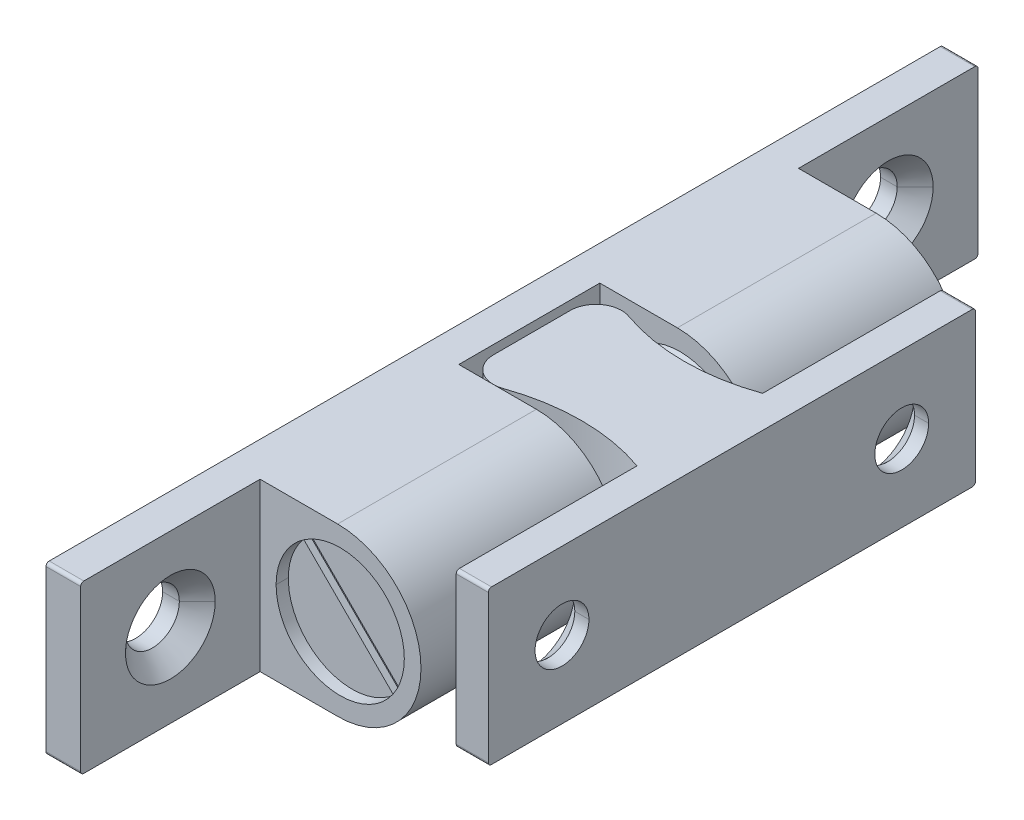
ISO-10303-21;
HEADER;
FILE_DESCRIPTION(('STEP AP214'),'2;1');
FILE_NAME('part.step','',(''),(''),'','','');
FILE_SCHEMA(('AUTOMOTIVE_DESIGN { 1 0 10303 214 1 1 1 1 }'));
ENDSEC;
DATA;
#1=APPLICATION_CONTEXT('core data for automotive mechanical design processes');
#2=APPLICATION_PROTOCOL_DEFINITION('international standard','automotive_design',2000,#1);
#3=PRODUCT_CONTEXT('',#1,'mechanical');
#4=PRODUCT('Part','Part','',(#3));
#5=PRODUCT_RELATED_PRODUCT_CATEGORY('part','',(#4));
#6=PRODUCT_DEFINITION_FORMATION('','',#4);
#7=PRODUCT_DEFINITION_CONTEXT('part definition',#1,'design');
#8=PRODUCT_DEFINITION('design','',#6,#7);
#9=PRODUCT_DEFINITION_SHAPE('','',#8);
#10=(LENGTH_UNIT() NAMED_UNIT(*) SI_UNIT(.MILLI.,.METRE.));
#11=(NAMED_UNIT(*) PLANE_ANGLE_UNIT() SI_UNIT($,.RADIAN.));
#12=(NAMED_UNIT(*) SI_UNIT($,.STERADIAN.) SOLID_ANGLE_UNIT());
#13=UNCERTAINTY_MEASURE_WITH_UNIT(LENGTH_MEASURE(1.E-05),#10,'distance_accuracy_value','');
#14=(GEOMETRIC_REPRESENTATION_CONTEXT(3) GLOBAL_UNCERTAINTY_ASSIGNED_CONTEXT((#13)) GLOBAL_UNIT_ASSIGNED_CONTEXT((#10,
#11,#12)) REPRESENTATION_CONTEXT('',''));
#15=CARTESIAN_POINT('',(0.,0.,0.));
#16=DIRECTION('',(0.,0.,1.));
#17=DIRECTION('',(1.,0.,0.));
#18=AXIS2_PLACEMENT_3D('',#15,#16,#17);
#19=CARTESIAN_POINT('',(3.34101109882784,-5.75,47.25));
#20=DIRECTION('',(-1.,0.,0.));
#21=DIRECTION('',(0.,0.,1.));
#22=AXIS2_PLACEMENT_3D('',#19,#20,#21);
#23=CYLINDRICAL_SURFACE('',#22,0.25);
#24=CARTESIAN_POINT('',(16.,-5.75,47.25));
#25=DIRECTION('',(-1.,0.,0.));
#26=DIRECTION('',(0.,0.,1.));
#27=AXIS2_PLACEMENT_3D('',#24,#25,#26);
#28=CIRCLE('',#27,0.25);
#29=CARTESIAN_POINT('',(16.,-6.,47.25));
#30=VERTEX_POINT('',#29);
#31=CARTESIAN_POINT('',(16.,-5.75,47.5));
#32=VERTEX_POINT('',#31);
#33=EDGE_CURVE('P0_E327',#30,#32,#28,.T.);
#34=ORIENTED_EDGE('',*,*,#33,.F.);
#35=DIRECTION('',(-1.,0.,0.));
#36=VECTOR('',#35,1.);
#37=CARTESIAN_POINT('',(16.,-6.,47.25));
#38=LINE('',#37,#36);
#39=CARTESIAN_POINT('',(18.5,-6.,47.25));
#40=VERTEX_POINT('',#39);
#41=EDGE_CURVE('P0_E311',#40,#30,#38,.T.);
#42=ORIENTED_EDGE('',*,*,#41,.F.);
#43=CARTESIAN_POINT('',(18.5,-5.75,47.25));
#44=DIRECTION('',(1.,0.,0.));
#45=DIRECTION('',(0.,0.,-1.));
#46=AXIS2_PLACEMENT_3D('',#43,#44,#45);
#47=CIRCLE('',#46,0.25);
#48=CARTESIAN_POINT('',(18.5,-5.75,47.5));
#49=VERTEX_POINT('',#48);
#50=EDGE_CURVE('P0_E392',#49,#40,#47,.T.);
#51=ORIENTED_EDGE('',*,*,#50,.F.);
#52=DIRECTION('',(1.,0.,0.));
#53=VECTOR('',#52,1.);
#54=CARTESIAN_POINT('',(18.5,-5.75,47.5));
#55=LINE('',#54,#53);
#56=EDGE_CURVE('P0_E38',#32,#49,#55,.T.);
#57=ORIENTED_EDGE('',*,*,#56,.F.);
#58=EDGE_LOOP('',(#34,#42,#51,#57));
#59=FACE_BOUND('',#58,.T.);
#60=ADVANCED_FACE('P0_F17',(#59),#23,.T.);
#61=CARTESIAN_POINT('',(14.5064666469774,5.75,47.25));
#62=DIRECTION('',(1.,0.,0.));
#63=DIRECTION('',(0.,0.,-1.));
#64=AXIS2_PLACEMENT_3D('',#61,#62,#63);
#65=CYLINDRICAL_SURFACE('',#64,0.25);
#66=CARTESIAN_POINT('',(16.,5.75,47.25));
#67=DIRECTION('',(-1.,0.,0.));
#68=DIRECTION('',(0.,0.,1.));
#69=AXIS2_PLACEMENT_3D('',#66,#67,#68);
#70=CIRCLE('',#69,0.25);
#71=CARTESIAN_POINT('',(16.,5.75,47.5));
#72=VERTEX_POINT('',#71);
#73=CARTESIAN_POINT('',(16.,6.,47.25));
#74=VERTEX_POINT('',#73);
#75=EDGE_CURVE('P0_E328',#72,#74,#70,.T.);
#76=ORIENTED_EDGE('',*,*,#75,.F.);
#77=DIRECTION('',(-1.,0.,0.));
#78=VECTOR('',#77,1.);
#79=CARTESIAN_POINT('',(3.34101109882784,5.75,47.5));
#80=LINE('',#79,#78);
#81=CARTESIAN_POINT('',(18.5,5.75,47.5));
#82=VERTEX_POINT('',#81);
#83=EDGE_CURVE('P0_E49',#82,#72,#80,.T.);
#84=ORIENTED_EDGE('',*,*,#83,.F.);
#85=CARTESIAN_POINT('',(18.5,5.75,47.25));
#86=DIRECTION('',(1.,0.,0.));
#87=DIRECTION('',(0.,0.,-1.));
#88=AXIS2_PLACEMENT_3D('',#85,#86,#87);
#89=CIRCLE('',#88,0.25);
#90=CARTESIAN_POINT('',(18.5,6.,47.25));
#91=VERTEX_POINT('',#90);
#92=EDGE_CURVE('P0_E276',#91,#82,#89,.T.);
#93=ORIENTED_EDGE('',*,*,#92,.F.);
#94=DIRECTION('',(1.,0.,0.));
#95=VECTOR('',#94,1.);
#96=CARTESIAN_POINT('',(14.5064666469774,6.,47.25));
#97=LINE('',#96,#95);
#98=EDGE_CURVE('P0_E337',#74,#91,#97,.T.);
#99=ORIENTED_EDGE('',*,*,#98,.F.);
#100=EDGE_LOOP('',(#76,#84,#93,#99));
#101=FACE_BOUND('',#100,.T.);
#102=ADVANCED_FACE('P0_F465',(#101),#65,.T.);
#103=CARTESIAN_POINT('',(14.5064666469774,-5.75,9.75));
#104=DIRECTION('',(-1.,0.,0.));
#105=DIRECTION('',(0.,0.,1.));
#106=AXIS2_PLACEMENT_3D('',#103,#104,#105);
#107=CYLINDRICAL_SURFACE('',#106,0.25);
#108=CARTESIAN_POINT('',(16.,-5.75,9.75));
#109=DIRECTION('',(-1.,0.,0.));
#110=DIRECTION('',(0.,0.,1.));
#111=AXIS2_PLACEMENT_3D('',#108,#109,#110);
#112=CIRCLE('',#111,0.25);
#113=CARTESIAN_POINT('',(16.,-5.75,9.5));
#114=VERTEX_POINT('',#113);
#115=CARTESIAN_POINT('',(16.,-6.,9.75));
#116=VERTEX_POINT('',#115);
#117=EDGE_CURVE('P0_E285',#114,#116,#112,.T.);
#118=ORIENTED_EDGE('',*,*,#117,.F.);
#119=DIRECTION('',(-1.,0.,0.));
#120=VECTOR('',#119,1.);
#121=CARTESIAN_POINT('',(16.,-5.75,9.5));
#122=LINE('',#121,#120);
#123=CARTESIAN_POINT('',(18.5,-5.75,9.5));
#124=VERTEX_POINT('',#123);
#125=EDGE_CURVE('P0_E11',#124,#114,#122,.T.);
#126=ORIENTED_EDGE('',*,*,#125,.F.);
#127=CARTESIAN_POINT('',(18.5,-5.75,9.75));
#128=DIRECTION('',(1.,0.,0.));
#129=DIRECTION('',(0.,0.,-1.));
#130=AXIS2_PLACEMENT_3D('',#127,#128,#129);
#131=CIRCLE('',#130,0.25);
#132=CARTESIAN_POINT('',(18.5,-6.,9.75));
#133=VERTEX_POINT('',#132);
#134=EDGE_CURVE('P0_E418',#133,#124,#131,.T.);
#135=ORIENTED_EDGE('',*,*,#134,.F.);
#136=DIRECTION('',(1.,0.,0.));
#137=VECTOR('',#136,1.);
#138=CARTESIAN_POINT('',(18.5,-6.,9.75));
#139=LINE('',#138,#137);
#140=EDGE_CURVE('P0_E251',#116,#133,#139,.T.);
#141=ORIENTED_EDGE('',*,*,#140,.F.);
#142=EDGE_LOOP('',(#118,#126,#135,#141));
#143=FACE_BOUND('',#142,.T.);
#144=ADVANCED_FACE('P0_F453',(#143),#107,.T.);
#145=CARTESIAN_POINT('',(3.34101109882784,5.75,9.75));
#146=DIRECTION('',(1.,0.,0.));
#147=DIRECTION('',(0.,0.,-1.));
#148=AXIS2_PLACEMENT_3D('',#145,#146,#147);
#149=CYLINDRICAL_SURFACE('',#148,0.25);
#150=CARTESIAN_POINT('',(16.,5.75,9.75));
#151=DIRECTION('',(-1.,0.,0.));
#152=DIRECTION('',(0.,0.,1.));
#153=AXIS2_PLACEMENT_3D('',#150,#151,#152);
#154=CIRCLE('',#153,0.25);
#155=CARTESIAN_POINT('',(16.,6.,9.75));
#156=VERTEX_POINT('',#155);
#157=CARTESIAN_POINT('',(16.,5.75,9.5));
#158=VERTEX_POINT('',#157);
#159=EDGE_CURVE('P0_E286',#156,#158,#154,.T.);
#160=ORIENTED_EDGE('',*,*,#159,.F.);
#161=DIRECTION('',(-1.,0.,0.));
#162=VECTOR('',#161,1.);
#163=CARTESIAN_POINT('',(14.5064666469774,6.,9.75));
#164=LINE('',#163,#162);
#165=CARTESIAN_POINT('',(18.5,6.,9.75));
#166=VERTEX_POINT('',#165);
#167=EDGE_CURVE('P0_E353',#166,#156,#164,.T.);
#168=ORIENTED_EDGE('',*,*,#167,.F.);
#169=CARTESIAN_POINT('',(18.5,5.75,9.75));
#170=DIRECTION('',(1.,0.,0.));
#171=DIRECTION('',(0.,0.,-1.));
#172=AXIS2_PLACEMENT_3D('',#169,#170,#171);
#173=CIRCLE('',#172,0.25);
#174=CARTESIAN_POINT('',(18.5,5.75,9.5));
#175=VERTEX_POINT('',#174);
#176=EDGE_CURVE('P0_E281',#175,#166,#173,.T.);
#177=ORIENTED_EDGE('',*,*,#176,.F.);
#178=DIRECTION('',(1.,0.,0.));
#179=VECTOR('',#178,1.);
#180=CARTESIAN_POINT('',(3.34101109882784,5.75,9.5));
#181=LINE('',#180,#179);
#182=EDGE_CURVE('P0_E25',#158,#175,#181,.T.);
#183=ORIENTED_EDGE('',*,*,#182,.F.);
#184=EDGE_LOOP('',(#160,#168,#177,#183));
#185=FACE_BOUND('',#184,.T.);
#186=ADVANCED_FACE('P0_F445',(#185),#149,.T.);
#187=CARTESIAN_POINT('',(3.34101109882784,6.,9.5));
#188=DIRECTION('',(0.,0.,1.));
#189=DIRECTION('',(0.,-1.,0.));
#190=AXIS2_PLACEMENT_3D('',#187,#188,#189);
#191=PLANE('',#190);
#192=DIRECTION('',(0.,-1.,0.));
#193=VECTOR('',#192,1.);
#194=CARTESIAN_POINT('',(16.,6.,9.5));
#195=LINE('',#194,#193);
#196=EDGE_CURVE('P0_E282',#158,#114,#195,.T.);
#197=ORIENTED_EDGE('',*,*,#196,.F.);
#198=ORIENTED_EDGE('',*,*,#182,.T.);
#199=DIRECTION('',(0.,-1.,0.));
#200=VECTOR('',#199,1.);
#201=CARTESIAN_POINT('',(18.5,6.,9.5));
#202=LINE('',#201,#200);
#203=EDGE_CURVE('P0_E410',#175,#124,#202,.T.);
#204=ORIENTED_EDGE('',*,*,#203,.T.);
#205=ORIENTED_EDGE('',*,*,#125,.T.);
#206=EDGE_LOOP('',(#197,#198,#204,#205));
#207=FACE_BOUND('',#206,.T.);
#208=ADVANCED_FACE('P0_F441',(#207),#191,.F.);
#209=CARTESIAN_POINT('',(3.34101109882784,6.,47.5));
#210=DIRECTION('',(0.,0.,-1.));
#211=DIRECTION('',(0.,-1.,0.));
#212=AXIS2_PLACEMENT_3D('',#209,#210,#211);
#213=PLANE('',#212);
#214=DIRECTION('',(0.,1.,0.));
#215=VECTOR('',#214,1.);
#216=CARTESIAN_POINT('',(18.5,6.,47.5));
#217=LINE('',#216,#215);
#218=EDGE_CURVE('P0_E280',#49,#82,#217,.T.);
#219=ORIENTED_EDGE('',*,*,#218,.T.);
#220=ORIENTED_EDGE('',*,*,#83,.T.);
#221=DIRECTION('',(0.,-1.,0.));
#222=VECTOR('',#221,1.);
#223=CARTESIAN_POINT('',(16.,6.,47.5));
#224=LINE('',#223,#222);
#225=EDGE_CURVE('P0_E381',#72,#32,#224,.T.);
#226=ORIENTED_EDGE('',*,*,#225,.T.);
#227=ORIENTED_EDGE('',*,*,#56,.T.);
#228=EDGE_LOOP('',(#219,#220,#226,#227));
#229=FACE_BOUND('',#228,.T.);
#230=ADVANCED_FACE('P0_F467',(#229),#213,.F.);
#231=CARTESIAN_POINT('',(16.,0.,15.25));
#232=DIRECTION('',(-1.,0.,0.));
#233=DIRECTION('',(0.,0.,1.));
#234=AXIS2_PLACEMENT_3D('',#231,#232,#233);
#235=CONICAL_SURFACE('',#234,3.5,0.785398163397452);
#236=DIRECTION('',(-0.707106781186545,0.,-0.70710678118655));
#237=VECTOR('',#236,1.);
#238=CARTESIAN_POINT('',(16.,0.,11.75));
#239=LINE('',#238,#237);
#240=CARTESIAN_POINT('',(17.4,0.,13.15));
#241=VERTEX_POINT('',#240);
#242=CARTESIAN_POINT('',(16.,0.,11.75));
#243=VERTEX_POINT('',#242);
#244=EDGE_CURVE('P0_E210',#241,#243,#239,.T.);
#245=ORIENTED_EDGE('',*,*,#244,.F.);
#246=CARTESIAN_POINT('',(17.4,0.,15.25));
#247=DIRECTION('',(-1.,0.,0.));
#248=DIRECTION('',(0.,0.,1.));
#249=AXIS2_PLACEMENT_3D('',#246,#247,#248);
#250=CIRCLE('',#249,2.1);
#251=CARTESIAN_POINT('',(17.4,0.,17.35));
#252=VERTEX_POINT('',#251);
#253=EDGE_CURVE('P0_E203',#252,#241,#250,.T.);
#254=ORIENTED_EDGE('',*,*,#253,.F.);
#255=DIRECTION('',(-0.707106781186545,0.,0.70710678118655));
#256=VECTOR('',#255,1.);
#257=CARTESIAN_POINT('',(16.,0.,18.75));
#258=LINE('',#257,#256);
#259=CARTESIAN_POINT('',(16.,0.,18.75));
#260=VERTEX_POINT('',#259);
#261=EDGE_CURVE('P0_E207',#252,#260,#258,.T.);
#262=ORIENTED_EDGE('',*,*,#261,.T.);
#263=CARTESIAN_POINT('',(16.,0.,15.25));
#264=DIRECTION('',(-1.,0.,0.));
#265=DIRECTION('',(0.,0.,1.));
#266=AXIS2_PLACEMENT_3D('',#263,#264,#265);
#267=CIRCLE('',#266,3.5);
#268=EDGE_CURVE('P0_E407',#260,#243,#267,.T.);
#269=ORIENTED_EDGE('',*,*,#268,.T.);
#270=EDGE_LOOP('',(#245,#254,#262,#269));
#271=FACE_BOUND('',#270,.T.);
#272=ADVANCED_FACE('P0_F205',(#271),#235,.F.);
#273=CARTESIAN_POINT('',(16.,0.,15.25));
#274=DIRECTION('',(-1.,0.,0.));
#275=DIRECTION('',(0.,0.,1.));
#276=AXIS2_PLACEMENT_3D('',#273,#274,#275);
#277=CYLINDRICAL_SURFACE('',#276,2.1);
#278=DIRECTION('',(-1.,0.,0.));
#279=VECTOR('',#278,1.);
#280=CARTESIAN_POINT('',(16.,0.,13.15));
#281=LINE('',#280,#279);
#282=CARTESIAN_POINT('',(18.5,0.,13.15));
#283=VERTEX_POINT('',#282);
#284=EDGE_CURVE('P0_E228',#283,#241,#281,.T.);
#285=ORIENTED_EDGE('',*,*,#284,.F.);
#286=CARTESIAN_POINT('',(18.5,0.,15.25));
#287=DIRECTION('',(1.,0.,0.));
#288=DIRECTION('',(0.,0.,-1.));
#289=AXIS2_PLACEMENT_3D('',#286,#287,#288);
#290=CIRCLE('',#289,2.1);
#291=CARTESIAN_POINT('',(18.5,0.,17.35));
#292=VERTEX_POINT('',#291);
#293=EDGE_CURVE('P0_E221',#283,#292,#290,.T.);
#294=ORIENTED_EDGE('',*,*,#293,.T.);
#295=DIRECTION('',(-1.,0.,0.));
#296=VECTOR('',#295,1.);
#297=CARTESIAN_POINT('',(16.,0.,17.35));
#298=LINE('',#297,#296);
#299=EDGE_CURVE('P0_E219',#292,#252,#298,.T.);
#300=ORIENTED_EDGE('',*,*,#299,.T.);
#301=ORIENTED_EDGE('',*,*,#253,.T.);
#302=EDGE_LOOP('',(#285,#294,#300,#301));
#303=FACE_BOUND('',#302,.T.);
#304=ADVANCED_FACE('P0_F220',(#303),#277,.F.);
#305=CARTESIAN_POINT('',(16.,0.,41.75));
#306=DIRECTION('',(-1.,0.,0.));
#307=DIRECTION('',(0.,0.,1.));
#308=AXIS2_PLACEMENT_3D('',#305,#306,#307);
#309=CONICAL_SURFACE('',#308,3.5,0.785398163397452);
#310=DIRECTION('',(-0.707106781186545,0.,-0.70710678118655));
#311=VECTOR('',#310,1.);
#312=CARTESIAN_POINT('',(16.,0.,38.25));
#313=LINE('',#312,#311);
#314=CARTESIAN_POINT('',(17.4,0.,39.65));
#315=VERTEX_POINT('',#314);
#316=CARTESIAN_POINT('',(16.,0.,38.25));
#317=VERTEX_POINT('',#316);
#318=EDGE_CURVE('P0_E264',#315,#317,#313,.T.);
#319=ORIENTED_EDGE('',*,*,#318,.F.);
#320=CARTESIAN_POINT('',(17.4,0.,41.75));
#321=DIRECTION('',(-1.,0.,0.));
#322=DIRECTION('',(0.,0.,1.));
#323=AXIS2_PLACEMENT_3D('',#320,#321,#322);
#324=CIRCLE('',#323,2.1);
#325=CARTESIAN_POINT('',(17.4,0.,43.85));
#326=VERTEX_POINT('',#325);
#327=EDGE_CURVE('P0_E216',#326,#315,#324,.T.);
#328=ORIENTED_EDGE('',*,*,#327,.F.);
#329=DIRECTION('',(-0.707106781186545,0.,0.70710678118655));
#330=VECTOR('',#329,1.);
#331=CARTESIAN_POINT('',(16.,0.,45.25));
#332=LINE('',#331,#330);
#333=CARTESIAN_POINT('',(16.,0.,45.25));
#334=VERTEX_POINT('',#333);
#335=EDGE_CURVE('P0_E257',#326,#334,#332,.T.);
#336=ORIENTED_EDGE('',*,*,#335,.T.);
#337=CARTESIAN_POINT('',(16.,0.,41.75));
#338=DIRECTION('',(-1.,0.,0.));
#339=DIRECTION('',(0.,0.,1.));
#340=AXIS2_PLACEMENT_3D('',#337,#338,#339);
#341=CIRCLE('',#340,3.5);
#342=EDGE_CURVE('P0_E357',#334,#317,#341,.T.);
#343=ORIENTED_EDGE('',*,*,#342,.T.);
#344=EDGE_LOOP('',(#319,#328,#336,#343));
#345=FACE_BOUND('',#344,.T.);
#346=ADVANCED_FACE('P0_F522',(#345),#309,.F.);
#347=CARTESIAN_POINT('',(16.,0.,41.75));
#348=DIRECTION('',(-1.,0.,0.));
#349=DIRECTION('',(0.,0.,1.));
#350=AXIS2_PLACEMENT_3D('',#347,#348,#349);
#351=CYLINDRICAL_SURFACE('',#350,2.1);
#352=DIRECTION('',(-1.,0.,0.));
#353=VECTOR('',#352,1.);
#354=CARTESIAN_POINT('',(16.,0.,39.65));
#355=LINE('',#354,#353);
#356=CARTESIAN_POINT('',(18.5,0.,39.65));
#357=VERTEX_POINT('',#356);
#358=EDGE_CURVE('P0_E256',#357,#315,#355,.T.);
#359=ORIENTED_EDGE('',*,*,#358,.F.);
#360=CARTESIAN_POINT('',(18.5,0.,41.75));
#361=DIRECTION('',(1.,0.,0.));
#362=DIRECTION('',(0.,0.,-1.));
#363=AXIS2_PLACEMENT_3D('',#360,#361,#362);
#364=CIRCLE('',#363,2.1);
#365=CARTESIAN_POINT('',(18.5,0.,43.85));
#366=VERTEX_POINT('',#365);
#367=EDGE_CURVE('P0_E378',#357,#366,#364,.T.);
#368=ORIENTED_EDGE('',*,*,#367,.T.);
#369=DIRECTION('',(-1.,0.,0.));
#370=VECTOR('',#369,1.);
#371=CARTESIAN_POINT('',(16.,0.,43.85));
#372=LINE('',#371,#370);
#373=EDGE_CURVE('P0_E252',#366,#326,#372,.T.);
#374=ORIENTED_EDGE('',*,*,#373,.T.);
#375=ORIENTED_EDGE('',*,*,#327,.T.);
#376=EDGE_LOOP('',(#359,#368,#374,#375));
#377=FACE_BOUND('',#376,.T.);
#378=ADVANCED_FACE('P0_F525',(#377),#351,.F.);
#379=CARTESIAN_POINT('',(2.9,6.,28.5));
#380=DIRECTION('',(-1.,0.,0.));
#381=DIRECTION('',(0.,0.,1.));
#382=AXIS2_PLACEMENT_3D('',#379,#380,#381);
#383=PLANE('',#382);
#384=DIRECTION('',(0.,0.,1.));
#385=VECTOR('',#384,1.);
#386=CARTESIAN_POINT('',(2.9,-6.,31.5));
#387=LINE('',#386,#385);
#388=CARTESIAN_POINT('',(2.9,-6.,25.5));
#389=VERTEX_POINT('',#388);
#390=CARTESIAN_POINT('',(2.9,-6.,31.5));
#391=VERTEX_POINT('',#390);
#392=EDGE_CURVE('P0_E332',#389,#391,#387,.T.);
#393=ORIENTED_EDGE('',*,*,#392,.T.);
#394=DIRECTION('',(0.,-1.,0.));
#395=VECTOR('',#394,1.);
#396=CARTESIAN_POINT('',(2.9,6.,31.5));
#397=LINE('',#396,#395);
#398=CARTESIAN_POINT('',(2.9,6.,31.5));
#399=VERTEX_POINT('',#398);
#400=EDGE_CURVE('P0_E307',#399,#391,#397,.T.);
#401=ORIENTED_EDGE('',*,*,#400,.F.);
#402=DIRECTION('',(0.,0.,-1.));
#403=VECTOR('',#402,1.);
#404=CARTESIAN_POINT('',(2.9,6.,31.5));
#405=LINE('',#404,#403);
#406=CARTESIAN_POINT('',(2.9,6.,25.5));
#407=VERTEX_POINT('',#406);
#408=EDGE_CURVE('P0_E362',#399,#407,#405,.T.);
#409=ORIENTED_EDGE('',*,*,#408,.T.);
#410=DIRECTION('',(0.,-1.,0.));
#411=VECTOR('',#410,1.);
#412=CARTESIAN_POINT('',(2.9,6.,25.5));
#413=LINE('',#412,#411);
#414=EDGE_CURVE('P0_E333',#407,#389,#413,.T.);
#415=ORIENTED_EDGE('',*,*,#414,.T.);
#416=EDGE_LOOP('',(#393,#401,#409,#415));
#417=FACE_BOUND('',#416,.T.);
#418=ADVANCED_FACE('P0_F483',(#417),#383,.T.);
#419=CARTESIAN_POINT('',(4.89999999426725,6.,31.5000000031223));
#420=DIRECTION('',(0.,-1.,0.));
#421=DIRECTION('',(0.331482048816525,0.,0.94346152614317));
#422=AXIS2_PLACEMENT_3D('',#419,#420,#421);
#423=CYLINDRICAL_SURFACE('',#422,1.99999999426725);
#424=CARTESIAN_POINT('',(4.89999999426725,-6.,31.5000000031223));
#425=DIRECTION('',(0.,1.,0.));
#426=DIRECTION('',(0.331482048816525,0.,0.94346152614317));
#427=AXIS2_PLACEMENT_3D('',#424,#425,#426);
#428=CIRCLE('',#427,1.99999999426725);
#429=CARTESIAN_POINT('',(5.56296408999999,-6.,33.38692305));
#430=VERTEX_POINT('',#429);
#431=EDGE_CURVE('P0_E322',#391,#430,#428,.T.);
#432=ORIENTED_EDGE('',*,*,#431,.T.);
#433=DIRECTION('',(0.,-1.,0.));
#434=VECTOR('',#433,1.);
#435=CARTESIAN_POINT('',(5.56296408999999,6.,33.38692305));
#436=LINE('',#435,#434);
#437=CARTESIAN_POINT('',(5.56296408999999,6.,33.38692305));
#438=VERTEX_POINT('',#437);
#439=EDGE_CURVE('P0_E354',#438,#430,#436,.T.);
#440=ORIENTED_EDGE('',*,*,#439,.F.);
#441=CARTESIAN_POINT('',(4.89999999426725,6.,31.5000000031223));
#442=DIRECTION('',(0.,-1.,0.));
#443=DIRECTION('',(0.331482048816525,0.,0.94346152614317));
#444=AXIS2_PLACEMENT_3D('',#441,#442,#443);
#445=CIRCLE('',#444,1.99999999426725);
#446=EDGE_CURVE('P0_E377',#438,#399,#445,.T.);
#447=ORIENTED_EDGE('',*,*,#446,.T.);
#448=ORIENTED_EDGE('',*,*,#400,.T.);
#449=EDGE_LOOP('',(#432,#440,#447,#448));
#450=FACE_BOUND('',#449,.T.);
#451=ADVANCED_FACE('P0_F486',(#450),#423,.T.);
#452=CARTESIAN_POINT('',(10.7629465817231,6.,48.1870713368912));
#453=DIRECTION('',(0.,-1.,0.));
#454=DIRECTION('',(-0.331482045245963,0.,-0.943461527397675));
#455=AXIS2_PLACEMENT_3D('',#452,#453,#454);
#456=CYLINDRICAL_SURFACE('',#455,15.687071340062);
#457=CARTESIAN_POINT('',(10.7629465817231,-6.,48.1870713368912));
#458=DIRECTION('',(0.,-1.,0.));
#459=DIRECTION('',(-0.331482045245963,0.,-0.943461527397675));
#460=AXIS2_PLACEMENT_3D('',#457,#458,#459);
#461=CIRCLE('',#460,15.687071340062);
#462=CARTESIAN_POINT('',(16.,-6.,33.4));
#463=VERTEX_POINT('',#462);
#464=EDGE_CURVE('P0_E319',#430,#463,#461,.T.);
#465=ORIENTED_EDGE('',*,*,#464,.T.);
#466=DIRECTION('',(0.,-1.,0.));
#467=VECTOR('',#466,1.);
#468=CARTESIAN_POINT('',(16.,6.,33.4));
#469=LINE('',#468,#467);
#470=CARTESIAN_POINT('',(16.,6.,33.4));
#471=VERTEX_POINT('',#470);
#472=EDGE_CURVE('P0_E324',#471,#463,#469,.T.);
#473=ORIENTED_EDGE('',*,*,#472,.F.);
#474=CARTESIAN_POINT('',(10.7629465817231,6.,48.1870713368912));
#475=DIRECTION('',(0.,-1.,0.));
#476=DIRECTION('',(-0.331482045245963,0.,-0.943461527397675));
#477=AXIS2_PLACEMENT_3D('',#474,#475,#476);
#478=CIRCLE('',#477,15.687071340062);
#479=EDGE_CURVE('P0_E382',#438,#471,#478,.T.);
#480=ORIENTED_EDGE('',*,*,#479,.F.);
#481=ORIENTED_EDGE('',*,*,#439,.T.);
#482=EDGE_LOOP('',(#465,#473,#480,#481));
#483=FACE_BOUND('',#482,.T.);
#484=ADVANCED_FACE('P0_F489',(#483),#456,.F.);
#485=CARTESIAN_POINT('',(16.,6.,41.45));
#486=DIRECTION('',(-1.,0.,0.));
#487=DIRECTION('',(0.,0.,1.));
#488=AXIS2_PLACEMENT_3D('',#485,#486,#487);
#489=PLANE('',#488);
#490=ORIENTED_EDGE('',*,*,#342,.F.);
#491=CARTESIAN_POINT('',(16.,0.,41.75));
#492=DIRECTION('',(-1.,0.,0.));
#493=DIRECTION('',(0.,0.,1.));
#494=AXIS2_PLACEMENT_3D('',#491,#492,#493);
#495=CIRCLE('',#494,3.5);
#496=EDGE_CURVE('P0_E267',#317,#334,#495,.T.);
#497=ORIENTED_EDGE('',*,*,#496,.F.);
#498=EDGE_LOOP('',(#490,#497));
#499=FACE_BOUND('',#498,.T.);
#500=ORIENTED_EDGE('',*,*,#225,.F.);
#501=ORIENTED_EDGE('',*,*,#75,.T.);
#502=DIRECTION('',(0.,0.,-1.));
#503=VECTOR('',#502,1.);
#504=CARTESIAN_POINT('',(16.,6.,49.5));
#505=LINE('',#504,#503);
#506=EDGE_CURVE('P0_E386',#74,#471,#505,.T.);
#507=ORIENTED_EDGE('',*,*,#506,.T.);
#508=ORIENTED_EDGE('',*,*,#472,.T.);
#509=DIRECTION('',(0.,0.,1.));
#510=VECTOR('',#509,1.);
#511=CARTESIAN_POINT('',(16.,-6.,49.5));
#512=LINE('',#511,#510);
#513=EDGE_CURVE('P0_E315',#463,#30,#512,.T.);
#514=ORIENTED_EDGE('',*,*,#513,.T.);
#515=ORIENTED_EDGE('',*,*,#33,.T.);
#516=EDGE_LOOP('',(#500,#501,#507,#508,#514,#515));
#517=FACE_BOUND('',#516,.T.);
#518=ADVANCED_FACE('P0_F492',(#499,#517),#489,.T.);
#519=CARTESIAN_POINT('',(18.5,6.,28.5));
#520=DIRECTION('',(1.,0.,0.));
#521=DIRECTION('',(0.,1.,0.));
#522=AXIS2_PLACEMENT_3D('',#519,#520,#521);
#523=PLANE('',#522);
#524=CARTESIAN_POINT('',(18.5,0.,41.75));
#525=DIRECTION('',(1.,0.,0.));
#526=DIRECTION('',(0.,0.,-1.));
#527=AXIS2_PLACEMENT_3D('',#524,#525,#526);
#528=CIRCLE('',#527,2.1);
#529=EDGE_CURVE('P0_E253',#366,#357,#528,.T.);
#530=ORIENTED_EDGE('',*,*,#529,.F.);
#531=ORIENTED_EDGE('',*,*,#367,.F.);
#532=EDGE_LOOP('',(#530,#531));
#533=FACE_BOUND('',#532,.T.);
#534=CARTESIAN_POINT('',(18.5,0.,15.25));
#535=DIRECTION('',(1.,0.,0.));
#536=DIRECTION('',(0.,0.,-1.));
#537=AXIS2_PLACEMENT_3D('',#534,#535,#536);
#538=CIRCLE('',#537,2.1);
#539=EDGE_CURVE('P0_E236',#292,#283,#538,.T.);
#540=ORIENTED_EDGE('',*,*,#539,.F.);
#541=ORIENTED_EDGE('',*,*,#293,.F.);
#542=EDGE_LOOP('',(#540,#541));
#543=FACE_BOUND('',#542,.T.);
#544=ORIENTED_EDGE('',*,*,#203,.F.);
#545=ORIENTED_EDGE('',*,*,#176,.T.);
#546=DIRECTION('',(0.,0.,1.));
#547=VECTOR('',#546,1.);
#548=CARTESIAN_POINT('',(18.5,6.,7.5));
#549=LINE('',#548,#547);
#550=EDGE_CURVE('P0_E349',#166,#91,#549,.T.);
#551=ORIENTED_EDGE('',*,*,#550,.T.);
#552=ORIENTED_EDGE('',*,*,#92,.T.);
#553=ORIENTED_EDGE('',*,*,#218,.F.);
#554=ORIENTED_EDGE('',*,*,#50,.T.);
#555=DIRECTION('',(0.,0.,-1.));
#556=VECTOR('',#555,1.);
#557=CARTESIAN_POINT('',(18.5,-6.,7.5));
#558=LINE('',#557,#556);
#559=EDGE_CURVE('P0_E304',#40,#133,#558,.T.);
#560=ORIENTED_EDGE('',*,*,#559,.T.);
#561=ORIENTED_EDGE('',*,*,#134,.T.);
#562=EDGE_LOOP('',(#544,#545,#551,#552,#553,#554,#560,#561));
#563=FACE_BOUND('',#562,.T.);
#564=ADVANCED_FACE('P0_F448',(#533,#543,#563),#523,.T.);
#565=CARTESIAN_POINT('',(16.,6.,15.55));
#566=DIRECTION('',(-1.,0.,0.));
#567=DIRECTION('',(0.,0.,1.));
#568=AXIS2_PLACEMENT_3D('',#565,#566,#567);
#569=PLANE('',#568);
#570=ORIENTED_EDGE('',*,*,#268,.F.);
#571=CARTESIAN_POINT('',(16.,0.,15.25));
#572=DIRECTION('',(-1.,0.,0.));
#573=DIRECTION('',(0.,0.,1.));
#574=AXIS2_PLACEMENT_3D('',#571,#572,#573);
#575=CIRCLE('',#574,3.5);
#576=EDGE_CURVE('P0_E234',#243,#260,#575,.T.);
#577=ORIENTED_EDGE('',*,*,#576,.F.);
#578=EDGE_LOOP('',(#570,#577));
#579=FACE_BOUND('',#578,.T.);
#580=DIRECTION('',(0.,0.,-1.));
#581=VECTOR('',#580,1.);
#582=CARTESIAN_POINT('',(16.,6.,23.6));
#583=LINE('',#582,#581);
#584=CARTESIAN_POINT('',(16.,6.,23.6));
#585=VERTEX_POINT('',#584);
#586=EDGE_CURVE('P0_E367',#585,#156,#583,.T.);
#587=ORIENTED_EDGE('',*,*,#586,.T.);
#588=ORIENTED_EDGE('',*,*,#159,.T.);
#589=ORIENTED_EDGE('',*,*,#196,.T.);
#590=ORIENTED_EDGE('',*,*,#117,.T.);
#591=DIRECTION('',(0.,0.,1.));
#592=VECTOR('',#591,1.);
#593=CARTESIAN_POINT('',(16.,-6.,23.6));
#594=LINE('',#593,#592);
#595=CARTESIAN_POINT('',(16.,-6.,23.6));
#596=VERTEX_POINT('',#595);
#597=EDGE_CURVE('P0_E247',#116,#596,#594,.T.);
#598=ORIENTED_EDGE('',*,*,#597,.T.);
#599=DIRECTION('',(0.,-1.,0.));
#600=VECTOR('',#599,1.);
#601=CARTESIAN_POINT('',(16.,6.,23.6));
#602=LINE('',#601,#600);
#603=EDGE_CURVE('P0_E294',#585,#596,#602,.T.);
#604=ORIENTED_EDGE('',*,*,#603,.F.);
#605=EDGE_LOOP('',(#587,#588,#589,#590,#598,#604));
#606=FACE_BOUND('',#605,.T.);
#607=ADVANCED_FACE('P0_F456',(#579,#606),#569,.T.);
#608=CARTESIAN_POINT('',(10.7629465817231,6.,8.81292866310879));
#609=DIRECTION('',(0.,-1.,0.));
#610=DIRECTION('',(0.333845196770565,0.,0.942627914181));
#611=AXIS2_PLACEMENT_3D('',#608,#609,#610);
#612=CYLINDRICAL_SURFACE('',#611,15.687071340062);
#613=CARTESIAN_POINT('',(10.7629465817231,-6.,8.81292866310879));
#614=DIRECTION('',(0.,-1.,0.));
#615=DIRECTION('',(0.333845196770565,0.,0.942627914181));
#616=AXIS2_PLACEMENT_3D('',#613,#614,#615);
#617=CIRCLE('',#616,15.687071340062);
#618=CARTESIAN_POINT('',(5.56296409,-6.,23.61307695));
#619=VERTEX_POINT('',#618);
#620=EDGE_CURVE('P0_E345',#596,#619,#617,.T.);
#621=ORIENTED_EDGE('',*,*,#620,.T.);
#622=DIRECTION('',(0.,-1.,0.));
#623=VECTOR('',#622,1.);
#624=CARTESIAN_POINT('',(5.56296409,6.,23.61307695));
#625=LINE('',#624,#623);
#626=CARTESIAN_POINT('',(5.56296409,6.,23.61307695));
#627=VERTEX_POINT('',#626);
#628=EDGE_CURVE('P0_E336',#627,#619,#625,.T.);
#629=ORIENTED_EDGE('',*,*,#628,.F.);
#630=CARTESIAN_POINT('',(10.7629465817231,6.,8.81292866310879));
#631=DIRECTION('',(0.,-1.,0.));
#632=DIRECTION('',(0.333845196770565,0.,0.942627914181));
#633=AXIS2_PLACEMENT_3D('',#630,#631,#632);
#634=CIRCLE('',#633,15.687071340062);
#635=EDGE_CURVE('P0_E363',#585,#627,#634,.T.);
#636=ORIENTED_EDGE('',*,*,#635,.F.);
#637=ORIENTED_EDGE('',*,*,#603,.T.);
#638=EDGE_LOOP('',(#621,#629,#636,#637));
#639=FACE_BOUND('',#638,.T.);
#640=ADVANCED_FACE('P0_F476',(#639),#612,.F.);
#641=CARTESIAN_POINT('',(4.89999999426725,6.,25.4999999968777));
#642=DIRECTION('',(0.,-1.,0.));
#643=DIRECTION('',(-1.,0.,1.56114357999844E-09));
#644=AXIS2_PLACEMENT_3D('',#641,#642,#643);
#645=CYLINDRICAL_SURFACE('',#644,1.99999999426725);
#646=CARTESIAN_POINT('',(4.89999999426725,-6.,25.4999999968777));
#647=DIRECTION('',(0.,1.,0.));
#648=DIRECTION('',(-1.,0.,1.56114357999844E-09));
#649=AXIS2_PLACEMENT_3D('',#646,#647,#648);
#650=CIRCLE('',#649,1.99999999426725);
#651=EDGE_CURVE('P0_E341',#619,#389,#650,.T.);
#652=ORIENTED_EDGE('',*,*,#651,.T.);
#653=ORIENTED_EDGE('',*,*,#414,.F.);
#654=CARTESIAN_POINT('',(4.89999999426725,6.,25.4999999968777));
#655=DIRECTION('',(0.,-1.,0.));
#656=DIRECTION('',(-1.,0.,1.56114357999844E-09));
#657=AXIS2_PLACEMENT_3D('',#654,#655,#656);
#658=CIRCLE('',#657,1.99999999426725);
#659=EDGE_CURVE('P0_E358',#407,#627,#658,.T.);
#660=ORIENTED_EDGE('',*,*,#659,.T.);
#661=ORIENTED_EDGE('',*,*,#628,.T.);
#662=EDGE_LOOP('',(#652,#653,#660,#661));
#663=FACE_BOUND('',#662,.T.);
#664=ADVANCED_FACE('P0_F481',(#663),#645,.T.);
#665=CARTESIAN_POINT('',(14.5064666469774,6.,28.5));
#666=DIRECTION('',(0.,-1.,0.));
#667=DIRECTION('',(0.,0.,-1.));
#668=AXIS2_PLACEMENT_3D('',#665,#666,#667);
#669=PLANE('',#668);
#670=ORIENTED_EDGE('',*,*,#550,.F.);
#671=ORIENTED_EDGE('',*,*,#167,.T.);
#672=ORIENTED_EDGE('',*,*,#586,.F.);
#673=ORIENTED_EDGE('',*,*,#635,.T.);
#674=ORIENTED_EDGE('',*,*,#659,.F.);
#675=ORIENTED_EDGE('',*,*,#408,.F.);
#676=ORIENTED_EDGE('',*,*,#446,.F.);
#677=ORIENTED_EDGE('',*,*,#479,.T.);
#678=ORIENTED_EDGE('',*,*,#506,.F.);
#679=ORIENTED_EDGE('',*,*,#98,.T.);
#680=EDGE_LOOP('',(#670,#671,#672,#673,#674,#675,#676,#677,#678,#679));
#681=FACE_BOUND('',#680,.T.);
#682=ADVANCED_FACE('P0_F460',(#681),#669,.F.);
#683=CARTESIAN_POINT('',(14.5064666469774,-6.,28.5));
#684=DIRECTION('',(0.,-1.,0.));
#685=DIRECTION('',(0.,0.,-1.));
#686=AXIS2_PLACEMENT_3D('',#683,#684,#685);
#687=PLANE('',#686);
#688=ORIENTED_EDGE('',*,*,#597,.F.);
#689=ORIENTED_EDGE('',*,*,#140,.T.);
#690=ORIENTED_EDGE('',*,*,#559,.F.);
#691=ORIENTED_EDGE('',*,*,#41,.T.);
#692=ORIENTED_EDGE('',*,*,#513,.F.);
#693=ORIENTED_EDGE('',*,*,#464,.F.);
#694=ORIENTED_EDGE('',*,*,#431,.F.);
#695=ORIENTED_EDGE('',*,*,#392,.F.);
#696=ORIENTED_EDGE('',*,*,#651,.F.);
#697=ORIENTED_EDGE('',*,*,#620,.F.);
#698=EDGE_LOOP('',(#688,#689,#690,#691,#692,#693,#694,#695,#696,#697));
#699=FACE_BOUND('',#698,.T.);
#700=ADVANCED_FACE('P0_F471',(#699),#687,.T.);
#701=CARTESIAN_POINT('',(16.,0.,41.75));
#702=DIRECTION('',(-1.,0.,0.));
#703=DIRECTION('',(0.,0.,1.));
#704=AXIS2_PLACEMENT_3D('',#701,#702,#703);
#705=CYLINDRICAL_SURFACE('',#704,2.1);
#706=ORIENTED_EDGE('',*,*,#529,.T.);
#707=ORIENTED_EDGE('',*,*,#358,.T.);
#708=CARTESIAN_POINT('',(17.4,0.,41.75));
#709=DIRECTION('',(-1.,0.,0.));
#710=DIRECTION('',(0.,0.,1.));
#711=AXIS2_PLACEMENT_3D('',#708,#709,#710);
#712=CIRCLE('',#711,2.1);
#713=EDGE_CURVE('P0_E227',#315,#326,#712,.T.);
#714=ORIENTED_EDGE('',*,*,#713,.T.);
#715=ORIENTED_EDGE('',*,*,#373,.F.);
#716=EDGE_LOOP('',(#706,#707,#714,#715));
#717=FACE_BOUND('',#716,.T.);
#718=ADVANCED_FACE('P0_F544',(#717),#705,.F.);
#719=CARTESIAN_POINT('',(16.,0.,41.75));
#720=DIRECTION('',(-1.,0.,0.));
#721=DIRECTION('',(0.,0.,1.));
#722=AXIS2_PLACEMENT_3D('',#719,#720,#721);
#723=CONICAL_SURFACE('',#722,3.5,0.785398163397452);
#724=ORIENTED_EDGE('',*,*,#713,.F.);
#725=ORIENTED_EDGE('',*,*,#318,.T.);
#726=ORIENTED_EDGE('',*,*,#496,.T.);
#727=ORIENTED_EDGE('',*,*,#335,.F.);
#728=EDGE_LOOP('',(#724,#725,#726,#727));
#729=FACE_BOUND('',#728,.T.);
#730=ADVANCED_FACE('P0_F541',(#729),#723,.F.);
#731=CARTESIAN_POINT('',(16.,0.,15.25));
#732=DIRECTION('',(-1.,0.,0.));
#733=DIRECTION('',(0.,0.,1.));
#734=AXIS2_PLACEMENT_3D('',#731,#732,#733);
#735=CYLINDRICAL_SURFACE('',#734,2.1);
#736=ORIENTED_EDGE('',*,*,#539,.T.);
#737=ORIENTED_EDGE('',*,*,#284,.T.);
#738=CARTESIAN_POINT('',(17.4,0.,15.25));
#739=DIRECTION('',(-1.,0.,0.));
#740=DIRECTION('',(0.,0.,1.));
#741=AXIS2_PLACEMENT_3D('',#738,#739,#740);
#742=CIRCLE('',#741,2.1);
#743=EDGE_CURVE('P0_E232',#241,#252,#742,.T.);
#744=ORIENTED_EDGE('',*,*,#743,.T.);
#745=ORIENTED_EDGE('',*,*,#299,.F.);
#746=EDGE_LOOP('',(#736,#737,#744,#745));
#747=FACE_BOUND('',#746,.T.);
#748=ADVANCED_FACE('P0_F238',(#747),#735,.F.);
#749=CARTESIAN_POINT('',(16.,0.,15.25));
#750=DIRECTION('',(-1.,0.,0.));
#751=DIRECTION('',(0.,0.,1.));
#752=AXIS2_PLACEMENT_3D('',#749,#750,#751);
#753=CONICAL_SURFACE('',#752,3.5,0.785398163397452);
#754=ORIENTED_EDGE('',*,*,#743,.F.);
#755=ORIENTED_EDGE('',*,*,#244,.T.);
#756=ORIENTED_EDGE('',*,*,#576,.T.);
#757=ORIENTED_EDGE('',*,*,#261,.F.);
#758=EDGE_LOOP('',(#754,#755,#756,#757));
#759=FACE_BOUND('',#758,.T.);
#760=ADVANCED_FACE('P0_F231',(#759),#753,.F.);
#761=CLOSED_SHELL('',(#60,#102,#144,#186,#208,#230,#272,#304,#346,#378,#418,#451,#484,#518,#564,
#607,#640,#664,#682,#700,#718,#730,#748,#760));
#762=MANIFOLD_SOLID_BREP('P0_B1',#761);
#763=CARTESIAN_POINT('',(9.,0.,20.4));
#764=DIRECTION('',(-0.707106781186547,0.707106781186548,0.));
#765=DIRECTION('',(-0.707106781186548,-0.707106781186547,0.));
#766=AXIS2_PLACEMENT_3D('',#763,#764,#765);
#767=SPHERICAL_SURFACE('',#766,5.);
#768=CARTESIAN_POINT('',(9.,0.,20.4));
#769=DIRECTION('',(0.707106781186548,-0.707106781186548,0.));
#770=DIRECTION('',(0.,0.,1.));
#771=AXIS2_PLACEMENT_3D('',#768,#769,#770);
#772=CIRCLE('',#771,5.);
#773=CARTESIAN_POINT('',(12.5355339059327,3.53553390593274,20.4));
#774=VERTEX_POINT('',#773);
#775=CARTESIAN_POINT('',(5.46446609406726,-3.53553390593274,20.4));
#776=VERTEX_POINT('',#775);
#777=EDGE_CURVE('P1_E127',#774,#776,#772,.T.);
#778=ORIENTED_EDGE('',*,*,#777,.F.);
#779=CARTESIAN_POINT('',(9.,0.,20.4));
#780=DIRECTION('',(0.,0.,-1.));
#781=DIRECTION('',(-0.707106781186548,-0.707106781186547,0.));
#782=AXIS2_PLACEMENT_3D('',#779,#780,#781);
#783=CIRCLE('',#782,5.);
#784=EDGE_CURVE('P1_E11',#776,#774,#783,.T.);
#785=ORIENTED_EDGE('',*,*,#784,.F.);
#786=EDGE_LOOP('',(#778,#785));
#787=FACE_BOUND('',#786,.T.);
#788=ADVANCED_FACE('P1_F17',(#787),#767,.T.);
#789=CARTESIAN_POINT('',(9.,0.,14.4));
#790=DIRECTION('',(0.,0.,-1.));
#791=DIRECTION('',(-0.707106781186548,-0.707106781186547,0.));
#792=AXIS2_PLACEMENT_3D('',#789,#790,#791);
#793=CYLINDRICAL_SURFACE('',#792,5.);
#794=DIRECTION('',(0.,0.,-1.));
#795=VECTOR('',#794,1.);
#796=CARTESIAN_POINT('',(5.46446609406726,-3.53553390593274,14.4));
#797=LINE('',#796,#795);
#798=CARTESIAN_POINT('',(5.46446609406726,-3.53553390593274,8.4));
#799=VERTEX_POINT('',#798);
#800=EDGE_CURVE('P1_E131',#776,#799,#797,.T.);
#801=ORIENTED_EDGE('',*,*,#800,.F.);
#802=ORIENTED_EDGE('',*,*,#784,.T.);
#803=DIRECTION('',(0.,0.,1.));
#804=VECTOR('',#803,1.);
#805=CARTESIAN_POINT('',(12.5355339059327,3.53553390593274,14.4));
#806=LINE('',#805,#804);
#807=CARTESIAN_POINT('',(12.5355339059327,3.53553390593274,8.4));
#808=VERTEX_POINT('',#807);
#809=EDGE_CURVE('P1_E113',#808,#774,#806,.T.);
#810=ORIENTED_EDGE('',*,*,#809,.F.);
#811=CARTESIAN_POINT('',(9.,0.,8.4));
#812=DIRECTION('',(0.,0.,-1.));
#813=DIRECTION('',(-0.707106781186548,-0.707106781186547,0.));
#814=AXIS2_PLACEMENT_3D('',#811,#812,#813);
#815=CIRCLE('',#814,5.);
#816=CARTESIAN_POINT('',(5.75864067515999,3.80704474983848,8.4));
#817=VERTEX_POINT('',#816);
#818=EDGE_CURVE('P1_E109',#817,#808,#815,.T.);
#819=ORIENTED_EDGE('',*,*,#818,.F.);
#820=DIRECTION('',(0.,0.,1.));
#821=VECTOR('',#820,1.);
#822=CARTESIAN_POINT('',(5.75864067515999,3.80704474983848,8.65));
#823=LINE('',#822,#821);
#824=CARTESIAN_POINT('',(5.75864067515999,3.80704474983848,8.9));
#825=VERTEX_POINT('',#824);
#826=EDGE_CURVE('P1_E98',#817,#825,#823,.T.);
#827=ORIENTED_EDGE('',*,*,#826,.T.);
#828=CARTESIAN_POINT('',(9.,0.,8.9));
#829=DIRECTION('',(0.,0.,1.));
#830=DIRECTION('',(-0.707106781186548,-0.707106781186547,0.));
#831=AXIS2_PLACEMENT_3D('',#828,#829,#830);
#832=CIRCLE('',#831,5.);
#833=CARTESIAN_POINT('',(5.1929552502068,3.2413593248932,8.9));
#834=VERTEX_POINT('',#833);
#835=EDGE_CURVE('P1_E155',#825,#834,#832,.T.);
#836=ORIENTED_EDGE('',*,*,#835,.T.);
#837=DIRECTION('',(0.,0.,-1.));
#838=VECTOR('',#837,1.);
#839=CARTESIAN_POINT('',(5.1929552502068,3.2413593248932,8.65));
#840=LINE('',#839,#838);
#841=CARTESIAN_POINT('',(5.1929552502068,3.2413593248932,8.4));
#842=VERTEX_POINT('',#841);
#843=EDGE_CURVE('P1_E26',#834,#842,#840,.T.);
#844=ORIENTED_EDGE('',*,*,#843,.T.);
#845=CARTESIAN_POINT('',(9.,0.,8.4));
#846=DIRECTION('',(0.,0.,-1.));
#847=DIRECTION('',(-0.707106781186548,-0.707106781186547,0.));
#848=AXIS2_PLACEMENT_3D('',#845,#846,#847);
#849=CIRCLE('',#848,5.);
#850=EDGE_CURVE('P1_E106',#799,#842,#849,.T.);
#851=ORIENTED_EDGE('',*,*,#850,.F.);
#852=EDGE_LOOP('',(#801,#802,#810,#819,#827,#836,#844,#851));
#853=FACE_BOUND('',#852,.T.);
#854=ADVANCED_FACE('P1_F111',(#853),#793,.T.);
#855=CARTESIAN_POINT('',(8.71715728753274,-0.282842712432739,8.65));
#856=DIRECTION('',(0.707106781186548,0.707106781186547,0.));
#857=DIRECTION('',(0.,0.,-1.));
#858=AXIS2_PLACEMENT_3D('',#855,#856,#857);
#859=PLANE('',#858);
#860=ORIENTED_EDGE('',*,*,#843,.F.);
#861=DIRECTION('',(0.707106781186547,-0.707106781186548,0.));
#862=VECTOR('',#861,1.);
#863=CARTESIAN_POINT('',(8.71715728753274,-0.282842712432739,8.9));
#864=LINE('',#863,#862);
#865=CARTESIAN_POINT('',(12.2413593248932,-3.8070447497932,8.9));
#866=VERTEX_POINT('',#865);
#867=EDGE_CURVE('P1_E73',#834,#866,#864,.T.);
#868=ORIENTED_EDGE('',*,*,#867,.T.);
#869=DIRECTION('',(0.,0.,1.));
#870=VECTOR('',#869,1.);
#871=CARTESIAN_POINT('',(12.2413593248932,-3.8070447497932,8.65));
#872=LINE('',#871,#870);
#873=CARTESIAN_POINT('',(12.2413593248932,-3.8070447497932,8.4));
#874=VERTEX_POINT('',#873);
#875=EDGE_CURVE('P1_E141',#874,#866,#872,.T.);
#876=ORIENTED_EDGE('',*,*,#875,.F.);
#877=DIRECTION('',(0.707106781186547,-0.707106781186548,0.));
#878=VECTOR('',#877,1.);
#879=CARTESIAN_POINT('',(8.71715728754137,-0.28284271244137,8.4));
#880=LINE('',#879,#878);
#881=EDGE_CURVE('P1_E148',#842,#874,#880,.T.);
#882=ORIENTED_EDGE('',*,*,#881,.F.);
#883=EDGE_LOOP('',(#860,#868,#876,#882));
#884=FACE_BOUND('',#883,.T.);
#885=ADVANCED_FACE('P1_F166',(#884),#859,.T.);
#886=CARTESIAN_POINT('',(9.00000000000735,4.188027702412E-11,8.9));
#887=DIRECTION('',(0.,0.,-1.));
#888=DIRECTION('',(0.,-1.,0.));
#889=AXIS2_PLACEMENT_3D('',#886,#887,#888);
#890=PLANE('',#889);
#891=ORIENTED_EDGE('',*,*,#835,.F.);
#892=DIRECTION('',(-0.707106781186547,0.707106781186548,0.));
#893=VECTOR('',#892,1.);
#894=CARTESIAN_POINT('',(9.28284271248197,0.282842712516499,8.9));
#895=LINE('',#894,#893);
#896=CARTESIAN_POINT('',(12.8070447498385,-3.24135932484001,8.9));
#897=VERTEX_POINT('',#896);
#898=EDGE_CURVE('P1_E65',#897,#825,#895,.T.);
#899=ORIENTED_EDGE('',*,*,#898,.F.);
#900=CARTESIAN_POINT('',(9.,0.,8.9));
#901=DIRECTION('',(0.,0.,1.));
#902=DIRECTION('',(-0.707106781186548,-0.707106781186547,0.));
#903=AXIS2_PLACEMENT_3D('',#900,#901,#902);
#904=CIRCLE('',#903,5.);
#905=EDGE_CURVE('P1_E145',#866,#897,#904,.T.);
#906=ORIENTED_EDGE('',*,*,#905,.F.);
#907=ORIENTED_EDGE('',*,*,#867,.F.);
#908=EDGE_LOOP('',(#891,#899,#906,#907));
#909=FACE_BOUND('',#908,.T.);
#910=ADVANCED_FACE('P1_F184',(#909),#890,.T.);
#911=CARTESIAN_POINT('',(9.28284271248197,0.282842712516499,8.65));
#912=DIRECTION('',(-0.707106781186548,-0.707106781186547,0.));
#913=DIRECTION('',(-0.707106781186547,0.707106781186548,0.));
#914=AXIS2_PLACEMENT_3D('',#911,#912,#913);
#915=PLANE('',#914);
#916=ORIENTED_EDGE('',*,*,#826,.F.);
#917=DIRECTION('',(-0.707106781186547,0.707106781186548,0.));
#918=VECTOR('',#917,1.);
#919=CARTESIAN_POINT('',(9.2828427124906,0.282842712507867,8.4));
#920=LINE('',#919,#918);
#921=CARTESIAN_POINT('',(12.8070447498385,-3.24135932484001,8.4));
#922=VERTEX_POINT('',#921);
#923=EDGE_CURVE('P1_E102',#922,#817,#920,.T.);
#924=ORIENTED_EDGE('',*,*,#923,.F.);
#925=DIRECTION('',(0.,0.,-1.));
#926=VECTOR('',#925,1.);
#927=CARTESIAN_POINT('',(12.8070447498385,-3.24135932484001,8.65));
#928=LINE('',#927,#926);
#929=EDGE_CURVE('P1_E90',#897,#922,#928,.T.);
#930=ORIENTED_EDGE('',*,*,#929,.F.);
#931=ORIENTED_EDGE('',*,*,#898,.T.);
#932=EDGE_LOOP('',(#916,#924,#930,#931));
#933=FACE_BOUND('',#932,.T.);
#934=ADVANCED_FACE('P1_F100',(#933),#915,.T.);
#935=CARTESIAN_POINT('',(7.23223304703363,-1.76776695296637,8.4));
#936=DIRECTION('',(0.,0.,-1.));
#937=DIRECTION('',(0.,-1.,0.));
#938=AXIS2_PLACEMENT_3D('',#935,#936,#937);
#939=PLANE('',#938);
#940=ORIENTED_EDGE('',*,*,#881,.T.);
#941=CARTESIAN_POINT('',(9.,0.,8.4));
#942=DIRECTION('',(0.,0.,-1.));
#943=DIRECTION('',(-0.707106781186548,-0.707106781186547,0.));
#944=AXIS2_PLACEMENT_3D('',#941,#942,#943);
#945=CIRCLE('',#944,5.);
#946=EDGE_CURVE('P1_E135',#874,#799,#945,.T.);
#947=ORIENTED_EDGE('',*,*,#946,.T.);
#948=ORIENTED_EDGE('',*,*,#850,.T.);
#949=EDGE_LOOP('',(#940,#947,#948));
#950=FACE_BOUND('',#949,.T.);
#951=ADVANCED_FACE('P1_F162',(#950),#939,.T.);
#952=CARTESIAN_POINT('',(9.,0.,14.4));
#953=DIRECTION('',(0.,0.,-1.));
#954=DIRECTION('',(-0.707106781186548,-0.707106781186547,0.));
#955=AXIS2_PLACEMENT_3D('',#952,#953,#954);
#956=CYLINDRICAL_SURFACE('',#955,5.);
#957=ORIENTED_EDGE('',*,*,#800,.T.);
#958=ORIENTED_EDGE('',*,*,#946,.F.);
#959=ORIENTED_EDGE('',*,*,#875,.T.);
#960=ORIENTED_EDGE('',*,*,#905,.T.);
#961=ORIENTED_EDGE('',*,*,#929,.T.);
#962=CARTESIAN_POINT('',(9.,0.,8.4));
#963=DIRECTION('',(0.,0.,-1.));
#964=DIRECTION('',(-0.707106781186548,-0.707106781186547,0.));
#965=AXIS2_PLACEMENT_3D('',#962,#963,#964);
#966=CIRCLE('',#965,5.);
#967=EDGE_CURVE('P1_E116',#808,#922,#966,.T.);
#968=ORIENTED_EDGE('',*,*,#967,.F.);
#969=ORIENTED_EDGE('',*,*,#809,.T.);
#970=CARTESIAN_POINT('',(9.,0.,20.4));
#971=DIRECTION('',(0.,0.,-1.));
#972=DIRECTION('',(-0.707106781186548,-0.707106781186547,0.));
#973=AXIS2_PLACEMENT_3D('',#970,#971,#972);
#974=CIRCLE('',#973,5.);
#975=EDGE_CURVE('P1_E120',#774,#776,#974,.T.);
#976=ORIENTED_EDGE('',*,*,#975,.T.);
#977=EDGE_LOOP('',(#957,#958,#959,#960,#961,#968,#969,#976));
#978=FACE_BOUND('',#977,.T.);
#979=ADVANCED_FACE('P1_F167',(#978),#956,.T.);
#980=CARTESIAN_POINT('',(7.23223304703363,-1.76776695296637,8.4));
#981=DIRECTION('',(0.,0.,-1.));
#982=DIRECTION('',(0.,-1.,0.));
#983=AXIS2_PLACEMENT_3D('',#980,#981,#982);
#984=PLANE('',#983);
#985=ORIENTED_EDGE('',*,*,#923,.T.);
#986=ORIENTED_EDGE('',*,*,#818,.T.);
#987=ORIENTED_EDGE('',*,*,#967,.T.);
#988=EDGE_LOOP('',(#985,#986,#987));
#989=FACE_BOUND('',#988,.T.);
#990=ADVANCED_FACE('P1_F118',(#989),#984,.T.);
#991=CARTESIAN_POINT('',(9.,0.,20.4));
#992=DIRECTION('',(-0.707106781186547,0.707106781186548,0.));
#993=DIRECTION('',(-0.707106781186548,-0.707106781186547,0.));
#994=AXIS2_PLACEMENT_3D('',#991,#992,#993);
#995=SPHERICAL_SURFACE('',#994,5.);
#996=ORIENTED_EDGE('',*,*,#777,.T.);
#997=ORIENTED_EDGE('',*,*,#975,.F.);
#998=EDGE_LOOP('',(#996,#997));
#999=FACE_BOUND('',#998,.T.);
#1000=ADVANCED_FACE('P1_F174',(#999),#995,.T.);
#1001=CLOSED_SHELL('',(#788,#854,#885,#910,#934,#951,#979,#990,#1000));
#1002=MANIFOLD_SOLID_BREP('P1_B1',#1001);
#1003=CARTESIAN_POINT('',(9.,0.,36.6));
#1004=DIRECTION('',(-0.707106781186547,0.707106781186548,0.));
#1005=DIRECTION('',(0.707106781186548,0.707106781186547,0.));
#1006=AXIS2_PLACEMENT_3D('',#1003,#1004,#1005);
#1007=SPHERICAL_SURFACE('',#1006,5.);
#1008=CARTESIAN_POINT('',(9.,0.,36.6));
#1009=DIRECTION('',(0.707106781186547,-0.707106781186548,0.));
#1010=DIRECTION('',(0.,0.,1.));
#1011=AXIS2_PLACEMENT_3D('',#1008,#1009,#1010);
#1012=CIRCLE('',#1011,5.);
#1013=CARTESIAN_POINT('',(5.46446609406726,-3.53553390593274,36.6));
#1014=VERTEX_POINT('',#1013);
#1015=CARTESIAN_POINT('',(12.5355339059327,3.53553390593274,36.6));
#1016=VERTEX_POINT('',#1015);
#1017=EDGE_CURVE('P2_E379',#1014,#1016,#1012,.T.);
#1018=ORIENTED_EDGE('',*,*,#1017,.F.);
#1019=CARTESIAN_POINT('',(9.,0.,36.6));
#1020=DIRECTION('',(0.,0.,1.));
#1021=DIRECTION('',(0.707106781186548,0.707106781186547,0.));
#1022=AXIS2_PLACEMENT_3D('',#1019,#1020,#1021);
#1023=CIRCLE('',#1022,5.);
#1024=EDGE_CURVE('P2_E11',#1016,#1014,#1023,.T.);
#1025=ORIENTED_EDGE('',*,*,#1024,.F.);
#1026=EDGE_LOOP('',(#1018,#1025));
#1027=FACE_BOUND('',#1026,.T.);
#1028=ADVANCED_FACE('P2_F17',(#1027),#1007,.T.);
#1029=CARTESIAN_POINT('',(9.,0.,42.6));
#1030=DIRECTION('',(0.,0.,1.));
#1031=DIRECTION('',(0.707106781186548,0.707106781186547,0.));
#1032=AXIS2_PLACEMENT_3D('',#1029,#1030,#1031);
#1033=CYLINDRICAL_SURFACE('',#1032,5.);
#1034=DIRECTION('',(0.,0.,1.));
#1035=VECTOR('',#1034,1.);
#1036=CARTESIAN_POINT('',(12.5355339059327,3.53553390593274,42.6));
#1037=LINE('',#1036,#1035);
#1038=CARTESIAN_POINT('',(12.5355339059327,3.53553390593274,48.6));
#1039=VERTEX_POINT('',#1038);
#1040=EDGE_CURVE('P2_E77',#1016,#1039,#1037,.T.);
#1041=ORIENTED_EDGE('',*,*,#1040,.F.);
#1042=ORIENTED_EDGE('',*,*,#1024,.T.);
#1043=DIRECTION('',(0.,0.,-1.));
#1044=VECTOR('',#1043,1.);
#1045=CARTESIAN_POINT('',(5.46446609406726,-3.53553390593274,42.6));
#1046=LINE('',#1045,#1044);
#1047=CARTESIAN_POINT('',(5.46446609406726,-3.53553390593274,48.6));
#1048=VERTEX_POINT('',#1047);
#1049=EDGE_CURVE('P2_E117',#1048,#1014,#1046,.T.);
#1050=ORIENTED_EDGE('',*,*,#1049,.F.);
#1051=CARTESIAN_POINT('',(9.,0.,48.6));
#1052=DIRECTION('',(0.,0.,1.));
#1053=DIRECTION('',(0.707106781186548,0.707106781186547,0.));
#1054=AXIS2_PLACEMENT_3D('',#1051,#1052,#1053);
#1055=CIRCLE('',#1054,5.);
#1056=CARTESIAN_POINT('',(5.19295525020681,3.2413593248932,48.6));
#1057=VERTEX_POINT('',#1056);
#1058=EDGE_CURVE('P2_E107',#1057,#1048,#1055,.T.);
#1059=ORIENTED_EDGE('',*,*,#1058,.F.);
#1060=DIRECTION('',(0.,0.,-1.));
#1061=VECTOR('',#1060,1.);
#1062=CARTESIAN_POINT('',(5.19295525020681,3.2413593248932,48.35));
#1063=LINE('',#1062,#1061);
#1064=CARTESIAN_POINT('',(5.19295525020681,3.2413593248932,48.1));
#1065=VERTEX_POINT('',#1064);
#1066=EDGE_CURVE('P2_E82',#1057,#1065,#1063,.T.);
#1067=ORIENTED_EDGE('',*,*,#1066,.T.);
#1068=CARTESIAN_POINT('',(9.,0.,48.1));
#1069=DIRECTION('',(0.,0.,-1.));
#1070=DIRECTION('',(0.707106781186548,0.707106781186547,0.));
#1071=AXIS2_PLACEMENT_3D('',#1068,#1069,#1070);
#1072=CIRCLE('',#1071,5.);
#1073=CARTESIAN_POINT('',(5.75864067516,3.80704474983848,48.1));
#1074=VERTEX_POINT('',#1073);
#1075=EDGE_CURVE('P2_E124',#1065,#1074,#1072,.T.);
#1076=ORIENTED_EDGE('',*,*,#1075,.T.);
#1077=DIRECTION('',(0.,0.,1.));
#1078=VECTOR('',#1077,1.);
#1079=CARTESIAN_POINT('',(5.75864067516,3.80704474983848,48.35));
#1080=LINE('',#1079,#1078);
#1081=CARTESIAN_POINT('',(5.75864067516,3.80704474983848,48.6));
#1082=VERTEX_POINT('',#1081);
#1083=EDGE_CURVE('P2_E20',#1074,#1082,#1080,.T.);
#1084=ORIENTED_EDGE('',*,*,#1083,.T.);
#1085=CARTESIAN_POINT('',(9.,0.,48.6));
#1086=DIRECTION('',(0.,0.,1.));
#1087=DIRECTION('',(0.707106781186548,0.707106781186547,0.));
#1088=AXIS2_PLACEMENT_3D('',#1085,#1086,#1087);
#1089=CIRCLE('',#1088,5.);
#1090=EDGE_CURVE('P2_E73',#1039,#1082,#1089,.T.);
#1091=ORIENTED_EDGE('',*,*,#1090,.F.);
#1092=EDGE_LOOP('',(#1041,#1042,#1050,#1059,#1067,#1076,#1084,#1091));
#1093=FACE_BOUND('',#1092,.T.);
#1094=ADVANCED_FACE('P2_F75',(#1093),#1033,.T.);
#1095=CARTESIAN_POINT('',(9.2828427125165,0.282842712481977,48.35));
#1096=DIRECTION('',(-0.707106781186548,-0.707106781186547,0.));
#1097=DIRECTION('',(-0.707106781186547,0.707106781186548,0.));
#1098=AXIS2_PLACEMENT_3D('',#1095,#1096,#1097);
#1099=PLANE('',#1098);
#1100=ORIENTED_EDGE('',*,*,#1083,.F.);
#1101=DIRECTION('',(0.707106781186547,-0.707106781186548,0.));
#1102=VECTOR('',#1101,1.);
#1103=CARTESIAN_POINT('',(9.2828427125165,0.282842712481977,48.1));
#1104=LINE('',#1103,#1102);
#1105=CARTESIAN_POINT('',(12.8070447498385,-3.24135932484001,48.1));
#1106=VERTEX_POINT('',#1105);
#1107=EDGE_CURVE('P2_E126',#1074,#1106,#1104,.T.);
#1108=ORIENTED_EDGE('',*,*,#1107,.T.);
#1109=DIRECTION('',(0.,0.,-1.));
#1110=VECTOR('',#1109,1.);
#1111=CARTESIAN_POINT('',(12.8070447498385,-3.24135932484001,48.35));
#1112=LINE('',#1111,#1110);
#1113=CARTESIAN_POINT('',(12.8070447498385,-3.24135932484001,48.6));
#1114=VERTEX_POINT('',#1113);
#1115=EDGE_CURVE('P2_E92',#1114,#1106,#1112,.T.);
#1116=ORIENTED_EDGE('',*,*,#1115,.F.);
#1117=DIRECTION('',(0.707106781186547,-0.707106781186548,0.));
#1118=VECTOR('',#1117,1.);
#1119=CARTESIAN_POINT('',(9.28284271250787,0.282842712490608,48.6));
#1120=LINE('',#1119,#1118);
#1121=EDGE_CURVE('P2_E83',#1082,#1114,#1120,.T.);
#1122=ORIENTED_EDGE('',*,*,#1121,.F.);
#1123=EDGE_LOOP('',(#1100,#1108,#1116,#1122));
#1124=FACE_BOUND('',#1123,.T.);
#1125=ADVANCED_FACE('P2_F158',(#1124),#1099,.T.);
#1126=CARTESIAN_POINT('',(9.00000000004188,7.35767002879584E-12,48.1));
#1127=DIRECTION('',(0.,0.,1.));
#1128=DIRECTION('',(1.,0.,0.));
#1129=AXIS2_PLACEMENT_3D('',#1126,#1127,#1128);
#1130=PLANE('',#1129);
#1131=ORIENTED_EDGE('',*,*,#1075,.F.);
#1132=DIRECTION('',(-0.707106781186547,0.707106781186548,0.));
#1133=VECTOR('',#1132,1.);
#1134=CARTESIAN_POINT('',(8.71715728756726,-0.282842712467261,48.1));
#1135=LINE('',#1134,#1133);
#1136=CARTESIAN_POINT('',(12.2413593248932,-3.8070447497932,48.1));
#1137=VERTEX_POINT('',#1136);
#1138=EDGE_CURVE('P2_E120',#1137,#1065,#1135,.T.);
#1139=ORIENTED_EDGE('',*,*,#1138,.F.);
#1140=CARTESIAN_POINT('',(9.,0.,48.1));
#1141=DIRECTION('',(0.,0.,-1.));
#1142=DIRECTION('',(0.707106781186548,0.707106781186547,0.));
#1143=AXIS2_PLACEMENT_3D('',#1140,#1141,#1142);
#1144=CIRCLE('',#1143,5.);
#1145=EDGE_CURVE('P2_E110',#1106,#1137,#1144,.T.);
#1146=ORIENTED_EDGE('',*,*,#1145,.F.);
#1147=ORIENTED_EDGE('',*,*,#1107,.F.);
#1148=EDGE_LOOP('',(#1131,#1139,#1146,#1147));
#1149=FACE_BOUND('',#1148,.T.);
#1150=ADVANCED_FACE('P2_F153',(#1149),#1130,.T.);
#1151=CARTESIAN_POINT('',(8.71715728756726,-0.282842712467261,48.35));
#1152=DIRECTION('',(0.707106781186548,0.707106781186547,0.));
#1153=DIRECTION('',(0.,0.,-1.));
#1154=AXIS2_PLACEMENT_3D('',#1151,#1152,#1153);
#1155=PLANE('',#1154);
#1156=ORIENTED_EDGE('',*,*,#1066,.F.);
#1157=DIRECTION('',(-0.707106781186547,0.707106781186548,0.));
#1158=VECTOR('',#1157,1.);
#1159=CARTESIAN_POINT('',(8.71715728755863,-0.282842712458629,48.6));
#1160=LINE('',#1159,#1158);
#1161=CARTESIAN_POINT('',(12.2413593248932,-3.8070447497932,48.6));
#1162=VERTEX_POINT('',#1161);
#1163=EDGE_CURVE('P2_E360',#1162,#1057,#1160,.T.);
#1164=ORIENTED_EDGE('',*,*,#1163,.F.);
#1165=DIRECTION('',(0.,0.,1.));
#1166=VECTOR('',#1165,1.);
#1167=CARTESIAN_POINT('',(12.2413593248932,-3.8070447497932,48.35));
#1168=LINE('',#1167,#1166);
#1169=EDGE_CURVE('P2_E113',#1137,#1162,#1168,.T.);
#1170=ORIENTED_EDGE('',*,*,#1169,.F.);
#1171=ORIENTED_EDGE('',*,*,#1138,.T.);
#1172=EDGE_LOOP('',(#1156,#1164,#1170,#1171));
#1173=FACE_BOUND('',#1172,.T.);
#1174=ADVANCED_FACE('P2_F157',(#1173),#1155,.T.);
#1175=CARTESIAN_POINT('',(10.7677669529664,1.76776695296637,48.6));
#1176=DIRECTION('',(0.,0.,1.));
#1177=DIRECTION('',(1.,0.,0.));
#1178=AXIS2_PLACEMENT_3D('',#1175,#1176,#1177);
#1179=PLANE('',#1178);
#1180=ORIENTED_EDGE('',*,*,#1121,.T.);
#1181=CARTESIAN_POINT('',(9.,0.,48.6));
#1182=DIRECTION('',(0.,0.,1.));
#1183=DIRECTION('',(0.707106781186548,0.707106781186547,0.));
#1184=AXIS2_PLACEMENT_3D('',#1181,#1182,#1183);
#1185=CIRCLE('',#1184,5.);
#1186=EDGE_CURVE('P2_E86',#1114,#1039,#1185,.T.);
#1187=ORIENTED_EDGE('',*,*,#1186,.T.);
#1188=ORIENTED_EDGE('',*,*,#1090,.T.);
#1189=EDGE_LOOP('',(#1180,#1187,#1188));
#1190=FACE_BOUND('',#1189,.T.);
#1191=ADVANCED_FACE('P2_F87',(#1190),#1179,.T.);
#1192=CARTESIAN_POINT('',(9.,0.,42.6));
#1193=DIRECTION('',(0.,0.,1.));
#1194=DIRECTION('',(0.707106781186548,0.707106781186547,0.));
#1195=AXIS2_PLACEMENT_3D('',#1192,#1193,#1194);
#1196=CYLINDRICAL_SURFACE('',#1195,5.);
#1197=ORIENTED_EDGE('',*,*,#1040,.T.);
#1198=ORIENTED_EDGE('',*,*,#1186,.F.);
#1199=ORIENTED_EDGE('',*,*,#1115,.T.);
#1200=ORIENTED_EDGE('',*,*,#1145,.T.);
#1201=ORIENTED_EDGE('',*,*,#1169,.T.);
#1202=CARTESIAN_POINT('',(9.,0.,48.6));
#1203=DIRECTION('',(0.,0.,1.));
#1204=DIRECTION('',(0.707106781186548,0.707106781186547,0.));
#1205=AXIS2_PLACEMENT_3D('',#1202,#1203,#1204);
#1206=CIRCLE('',#1205,5.);
#1207=EDGE_CURVE('P2_E100',#1048,#1162,#1206,.T.);
#1208=ORIENTED_EDGE('',*,*,#1207,.F.);
#1209=ORIENTED_EDGE('',*,*,#1049,.T.);
#1210=CARTESIAN_POINT('',(9.,0.,36.6));
#1211=DIRECTION('',(0.,0.,1.));
#1212=DIRECTION('',(0.707106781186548,0.707106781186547,0.));
#1213=AXIS2_PLACEMENT_3D('',#1210,#1211,#1212);
#1214=CIRCLE('',#1213,5.);
#1215=EDGE_CURVE('P2_E97',#1014,#1016,#1214,.T.);
#1216=ORIENTED_EDGE('',*,*,#1215,.T.);
#1217=EDGE_LOOP('',(#1197,#1198,#1199,#1200,#1201,#1208,#1209,#1216));
#1218=FACE_BOUND('',#1217,.T.);
#1219=ADVANCED_FACE('P2_F94',(#1218),#1196,.T.);
#1220=CARTESIAN_POINT('',(10.7677669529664,1.76776695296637,48.6));
#1221=DIRECTION('',(0.,0.,1.));
#1222=DIRECTION('',(1.,0.,0.));
#1223=AXIS2_PLACEMENT_3D('',#1220,#1221,#1222);
#1224=PLANE('',#1223);
#1225=ORIENTED_EDGE('',*,*,#1163,.T.);
#1226=ORIENTED_EDGE('',*,*,#1058,.T.);
#1227=ORIENTED_EDGE('',*,*,#1207,.T.);
#1228=EDGE_LOOP('',(#1225,#1226,#1227));
#1229=FACE_BOUND('',#1228,.T.);
#1230=ADVANCED_FACE('P2_F188',(#1229),#1224,.T.);
#1231=CARTESIAN_POINT('',(9.,0.,36.6));
#1232=DIRECTION('',(-0.707106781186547,0.707106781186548,0.));
#1233=DIRECTION('',(0.707106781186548,0.707106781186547,0.));
#1234=AXIS2_PLACEMENT_3D('',#1231,#1232,#1233);
#1235=SPHERICAL_SURFACE('',#1234,5.);
#1236=ORIENTED_EDGE('',*,*,#1017,.T.);
#1237=ORIENTED_EDGE('',*,*,#1215,.F.);
#1238=EDGE_LOOP('',(#1236,#1237));
#1239=FACE_BOUND('',#1238,.T.);
#1240=ADVANCED_FACE('P2_F196',(#1239),#1235,.T.);
#1241=CLOSED_SHELL('',(#1028,#1094,#1125,#1150,#1174,#1191,#1219,#1230,#1240));
#1242=MANIFOLD_SOLID_BREP('P2_B1',#1241);
#1243=CARTESIAN_POINT('',(4.375,-6.25,-6.25));
#1244=DIRECTION('',(-1.,0.,0.));
#1245=DIRECTION('',(0.,0.,1.));
#1246=AXIS2_PLACEMENT_3D('',#1243,#1244,#1245);
#1247=CYLINDRICAL_SURFACE('',#1246,0.25);
#1248=CARTESIAN_POINT('',(0.,-6.25,-6.25));
#1249=DIRECTION('',(-1.,0.,0.));
#1250=DIRECTION('',(0.,0.,1.));
#1251=AXIS2_PLACEMENT_3D('',#1248,#1249,#1250);
#1252=CIRCLE('',#1251,0.25);
#1253=CARTESIAN_POINT('',(0.,-6.25,-6.5));
#1254=VERTEX_POINT('',#1253);
#1255=CARTESIAN_POINT('',(0.,-6.5,-6.25));
#1256=VERTEX_POINT('',#1255);
#1257=EDGE_CURVE('P3_E374',#1254,#1256,#1252,.T.);
#1258=ORIENTED_EDGE('',*,*,#1257,.F.);
#1259=DIRECTION('',(-1.,0.,0.));
#1260=VECTOR('',#1259,1.);
#1261=CARTESIAN_POINT('',(0.,-6.25,-6.5));
#1262=LINE('',#1261,#1260);
#1263=CARTESIAN_POINT('',(2.7,-6.25,-6.5));
#1264=VERTEX_POINT('',#1263);
#1265=EDGE_CURVE('P3_E300',#1264,#1254,#1262,.T.);
#1266=ORIENTED_EDGE('',*,*,#1265,.F.);
#1267=CARTESIAN_POINT('',(2.7,-6.25,-6.25));
#1268=DIRECTION('',(1.,0.,0.));
#1269=DIRECTION('',(0.,0.,-1.));
#1270=AXIS2_PLACEMENT_3D('',#1267,#1268,#1269);
#1271=CIRCLE('',#1270,0.25);
#1272=CARTESIAN_POINT('',(2.7,-6.5,-6.25));
#1273=VERTEX_POINT('',#1272);
#1274=EDGE_CURVE('P3_E378',#1273,#1264,#1271,.T.);
#1275=ORIENTED_EDGE('',*,*,#1274,.F.);
#1276=DIRECTION('',(1.,0.,0.));
#1277=VECTOR('',#1276,1.);
#1278=CARTESIAN_POINT('',(2.7,-6.5,-6.25));
#1279=LINE('',#1278,#1277);
#1280=EDGE_CURVE('P3_E301',#1256,#1273,#1279,.T.);
#1281=ORIENTED_EDGE('',*,*,#1280,.F.);
#1282=EDGE_LOOP('',(#1258,#1266,#1275,#1281));
#1283=FACE_BOUND('',#1282,.T.);
#1284=ADVANCED_FACE('P3_F16',(#1283),#1247,.T.);
#1285=CARTESIAN_POINT('',(4.375,6.25,-6.25));
#1286=DIRECTION('',(1.,0.,0.));
#1287=DIRECTION('',(0.,0.,-1.));
#1288=AXIS2_PLACEMENT_3D('',#1285,#1286,#1287);
#1289=CYLINDRICAL_SURFACE('',#1288,0.25);
#1290=CARTESIAN_POINT('',(2.7,6.25,-6.25));
#1291=DIRECTION('',(1.,0.,0.));
#1292=DIRECTION('',(0.,0.,-1.));
#1293=AXIS2_PLACEMENT_3D('',#1290,#1291,#1292);
#1294=CIRCLE('',#1293,0.25);
#1295=CARTESIAN_POINT('',(2.7,6.25,-6.5));
#1296=VERTEX_POINT('',#1295);
#1297=CARTESIAN_POINT('',(2.7,6.5,-6.25));
#1298=VERTEX_POINT('',#1297);
#1299=EDGE_CURVE('P3_E424',#1296,#1298,#1294,.T.);
#1300=ORIENTED_EDGE('',*,*,#1299,.F.);
#1301=DIRECTION('',(1.,0.,0.));
#1302=VECTOR('',#1301,1.);
#1303=CARTESIAN_POINT('',(2.7,6.25,-6.5));
#1304=LINE('',#1303,#1302);
#1305=CARTESIAN_POINT('',(0.,6.25,-6.5));
#1306=VERTEX_POINT('',#1305);
#1307=EDGE_CURVE('P3_E292',#1306,#1296,#1304,.T.);
#1308=ORIENTED_EDGE('',*,*,#1307,.F.);
#1309=CARTESIAN_POINT('',(0.,6.25,-6.25));
#1310=DIRECTION('',(-1.,0.,0.));
#1311=DIRECTION('',(0.,0.,1.));
#1312=AXIS2_PLACEMENT_3D('',#1309,#1310,#1311);
#1313=CIRCLE('',#1312,0.25);
#1314=CARTESIAN_POINT('',(0.,6.5,-6.25));
#1315=VERTEX_POINT('',#1314);
#1316=EDGE_CURVE('P3_E371',#1315,#1306,#1313,.T.);
#1317=ORIENTED_EDGE('',*,*,#1316,.F.);
#1318=DIRECTION('',(-1.,0.,0.));
#1319=VECTOR('',#1318,1.);
#1320=CARTESIAN_POINT('',(0.,6.5,-6.25));
#1321=LINE('',#1320,#1319);
#1322=EDGE_CURVE('P3_E324',#1298,#1315,#1321,.T.);
#1323=ORIENTED_EDGE('',*,*,#1322,.F.);
#1324=EDGE_LOOP('',(#1300,#1308,#1317,#1323));
#1325=FACE_BOUND('',#1324,.T.);
#1326=ADVANCED_FACE('P3_F576',(#1325),#1289,.T.);
#1327=CARTESIAN_POINT('',(4.375,-6.25,63.25));
#1328=DIRECTION('',(-1.,0.,0.));
#1329=DIRECTION('',(0.,0.,1.));
#1330=AXIS2_PLACEMENT_3D('',#1327,#1328,#1329);
#1331=CYLINDRICAL_SURFACE('',#1330,0.25);
#1332=CARTESIAN_POINT('',(2.7,-6.25,63.25));
#1333=DIRECTION('',(1.,0.,0.));
#1334=DIRECTION('',(0.,0.,-1.));
#1335=AXIS2_PLACEMENT_3D('',#1332,#1333,#1334);
#1336=CIRCLE('',#1335,0.25);
#1337=CARTESIAN_POINT('',(2.7,-6.25,63.5));
#1338=VERTEX_POINT('',#1337);
#1339=CARTESIAN_POINT('',(2.7,-6.5,63.25));
#1340=VERTEX_POINT('',#1339);
#1341=EDGE_CURVE('P3_E451',#1338,#1340,#1336,.T.);
#1342=ORIENTED_EDGE('',*,*,#1341,.F.);
#1343=DIRECTION('',(1.,0.,0.));
#1344=VECTOR('',#1343,1.);
#1345=CARTESIAN_POINT('',(6.50871220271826,-6.25,63.5));
#1346=LINE('',#1345,#1344);
#1347=CARTESIAN_POINT('',(0.,-6.25,63.5));
#1348=VERTEX_POINT('',#1347);
#1349=EDGE_CURVE('P3_E401',#1348,#1338,#1346,.T.);
#1350=ORIENTED_EDGE('',*,*,#1349,.F.);
#1351=CARTESIAN_POINT('',(0.,-6.25,63.25));
#1352=DIRECTION('',(-1.,0.,0.));
#1353=DIRECTION('',(0.,0.,1.));
#1354=AXIS2_PLACEMENT_3D('',#1351,#1352,#1353);
#1355=CIRCLE('',#1354,0.25);
#1356=CARTESIAN_POINT('',(0.,-6.5,63.25));
#1357=VERTEX_POINT('',#1356);
#1358=EDGE_CURVE('P3_E388',#1357,#1348,#1355,.T.);
#1359=ORIENTED_EDGE('',*,*,#1358,.F.);
#1360=DIRECTION('',(-1.,0.,0.));
#1361=VECTOR('',#1360,1.);
#1362=CARTESIAN_POINT('',(4.375,-6.5,63.25));
#1363=LINE('',#1362,#1361);
#1364=EDGE_CURVE('P3_E320',#1340,#1357,#1363,.T.);
#1365=ORIENTED_EDGE('',*,*,#1364,.F.);
#1366=EDGE_LOOP('',(#1342,#1350,#1359,#1365));
#1367=FACE_BOUND('',#1366,.T.);
#1368=ADVANCED_FACE('P3_F581',(#1367),#1331,.T.);
#1369=CARTESIAN_POINT('',(4.375,6.25,63.25));
#1370=DIRECTION('',(1.,0.,0.));
#1371=DIRECTION('',(0.,0.,-1.));
#1372=AXIS2_PLACEMENT_3D('',#1369,#1370,#1371);
#1373=CYLINDRICAL_SURFACE('',#1372,0.25);
#1374=CARTESIAN_POINT('',(0.,6.25,63.25));
#1375=DIRECTION('',(-1.,0.,0.));
#1376=DIRECTION('',(0.,0.,1.));
#1377=AXIS2_PLACEMENT_3D('',#1374,#1375,#1376);
#1378=CIRCLE('',#1377,0.25);
#1379=CARTESIAN_POINT('',(0.,6.25,63.5));
#1380=VERTEX_POINT('',#1379);
#1381=CARTESIAN_POINT('',(0.,6.5,63.25));
#1382=VERTEX_POINT('',#1381);
#1383=EDGE_CURVE('P3_E329',#1380,#1382,#1378,.T.);
#1384=ORIENTED_EDGE('',*,*,#1383,.F.);
#1385=DIRECTION('',(-1.,0.,0.));
#1386=VECTOR('',#1385,1.);
#1387=CARTESIAN_POINT('',(6.50871220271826,6.25,63.5));
#1388=LINE('',#1387,#1386);
#1389=CARTESIAN_POINT('',(2.7,6.25,63.5));
#1390=VERTEX_POINT('',#1389);
#1391=EDGE_CURVE('P3_E398',#1390,#1380,#1388,.T.);
#1392=ORIENTED_EDGE('',*,*,#1391,.F.);
#1393=CARTESIAN_POINT('',(2.7,6.25,63.25));
#1394=DIRECTION('',(1.,0.,0.));
#1395=DIRECTION('',(0.,0.,-1.));
#1396=AXIS2_PLACEMENT_3D('',#1393,#1394,#1395);
#1397=CIRCLE('',#1396,0.25);
#1398=CARTESIAN_POINT('',(2.7,6.5,63.25));
#1399=VERTEX_POINT('',#1398);
#1400=EDGE_CURVE('P3_E461',#1399,#1390,#1397,.T.);
#1401=ORIENTED_EDGE('',*,*,#1400,.F.);
#1402=DIRECTION('',(1.,0.,0.));
#1403=VECTOR('',#1402,1.);
#1404=CARTESIAN_POINT('',(4.375,6.5,63.25));
#1405=LINE('',#1404,#1403);
#1406=EDGE_CURVE('P3_E393',#1382,#1399,#1405,.T.);
#1407=ORIENTED_EDGE('',*,*,#1406,.F.);
#1408=EDGE_LOOP('',(#1384,#1392,#1401,#1407));
#1409=FACE_BOUND('',#1408,.T.);
#1410=ADVANCED_FACE('P3_F610',(#1409),#1373,.T.);
#1411=CARTESIAN_POINT('',(2.7,0.,56.5));
#1412=DIRECTION('',(1.,0.,0.));
#1413=DIRECTION('',(0.,0.,-1.));
#1414=AXIS2_PLACEMENT_3D('',#1411,#1412,#1413);
#1415=CONICAL_SURFACE('',#1414,3.5,0.78539816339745);
#1416=DIRECTION('',(0.707106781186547,0.,0.707106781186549));
#1417=VECTOR('',#1416,1.);
#1418=CARTESIAN_POINT('',(2.7,0.,60.));
#1419=LINE('',#1418,#1417);
#1420=CARTESIAN_POINT('',(1.3,0.,58.6));
#1421=VERTEX_POINT('',#1420);
#1422=CARTESIAN_POINT('',(2.7,0.,60.));
#1423=VERTEX_POINT('',#1422);
#1424=EDGE_CURVE('P3_E522',#1421,#1423,#1419,.T.);
#1425=ORIENTED_EDGE('',*,*,#1424,.F.);
#1426=CARTESIAN_POINT('',(1.3,0.,56.5));
#1427=DIRECTION('',(1.,0.,0.));
#1428=DIRECTION('',(0.,0.,-1.));
#1429=AXIS2_PLACEMENT_3D('',#1426,#1427,#1428);
#1430=CIRCLE('',#1429,2.1);
#1431=CARTESIAN_POINT('',(1.3,0.,54.4));
#1432=VERTEX_POINT('',#1431);
#1433=EDGE_CURVE('P3_E10',#1432,#1421,#1430,.T.);
#1434=ORIENTED_EDGE('',*,*,#1433,.F.);
#1435=DIRECTION('',(0.707106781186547,0.,-0.707106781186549));
#1436=VECTOR('',#1435,1.);
#1437=CARTESIAN_POINT('',(2.7,0.,53.));
#1438=LINE('',#1437,#1436);
#1439=CARTESIAN_POINT('',(2.7,0.,53.));
#1440=VERTEX_POINT('',#1439);
#1441=EDGE_CURVE('P3_E521',#1432,#1440,#1438,.T.);
#1442=ORIENTED_EDGE('',*,*,#1441,.T.);
#1443=CARTESIAN_POINT('',(2.7,0.,56.5));
#1444=DIRECTION('',(1.,0.,0.));
#1445=DIRECTION('',(0.,0.,-1.));
#1446=AXIS2_PLACEMENT_3D('',#1443,#1444,#1445);
#1447=CIRCLE('',#1446,3.5);
#1448=EDGE_CURVE('P3_E450',#1440,#1423,#1447,.T.);
#1449=ORIENTED_EDGE('',*,*,#1448,.T.);
#1450=EDGE_LOOP('',(#1425,#1434,#1442,#1449));
#1451=FACE_BOUND('',#1450,.T.);
#1452=ADVANCED_FACE('P3_F572',(#1451),#1415,.F.);
#1453=CARTESIAN_POINT('',(2.7,0.,56.5));
#1454=DIRECTION('',(1.,0.,0.));
#1455=DIRECTION('',(0.,0.,-1.));
#1456=AXIS2_PLACEMENT_3D('',#1453,#1454,#1455);
#1457=CYLINDRICAL_SURFACE('',#1456,2.1);
#1458=DIRECTION('',(1.,0.,0.));
#1459=VECTOR('',#1458,1.);
#1460=CARTESIAN_POINT('',(2.7,0.,58.6));
#1461=LINE('',#1460,#1459);
#1462=CARTESIAN_POINT('',(0.,0.,58.6));
#1463=VERTEX_POINT('',#1462);
#1464=EDGE_CURVE('P3_E533',#1463,#1421,#1461,.T.);
#1465=ORIENTED_EDGE('',*,*,#1464,.F.);
#1466=CARTESIAN_POINT('',(0.,0.,56.5));
#1467=DIRECTION('',(-1.,0.,0.));
#1468=DIRECTION('',(0.,0.,1.));
#1469=AXIS2_PLACEMENT_3D('',#1466,#1467,#1468);
#1470=CIRCLE('',#1469,2.1);
#1471=CARTESIAN_POINT('',(0.,0.,54.4));
#1472=VERTEX_POINT('',#1471);
#1473=EDGE_CURVE('P3_E263',#1463,#1472,#1470,.T.);
#1474=ORIENTED_EDGE('',*,*,#1473,.T.);
#1475=DIRECTION('',(1.,0.,0.));
#1476=VECTOR('',#1475,1.);
#1477=CARTESIAN_POINT('',(2.7,0.,54.4));
#1478=LINE('',#1477,#1476);
#1479=EDGE_CURVE('P3_E537',#1472,#1432,#1478,.T.);
#1480=ORIENTED_EDGE('',*,*,#1479,.T.);
#1481=ORIENTED_EDGE('',*,*,#1433,.T.);
#1482=EDGE_LOOP('',(#1465,#1474,#1480,#1481));
#1483=FACE_BOUND('',#1482,.T.);
#1484=ADVANCED_FACE('P3_F563',(#1483),#1457,.F.);
#1485=CARTESIAN_POINT('',(2.7,0.,0.5));
#1486=DIRECTION('',(1.,0.,0.));
#1487=DIRECTION('',(0.,0.,-1.));
#1488=AXIS2_PLACEMENT_3D('',#1485,#1486,#1487);
#1489=CONICAL_SURFACE('',#1488,3.5,0.78539816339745);
#1490=DIRECTION('',(0.707106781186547,0.,0.707106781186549));
#1491=VECTOR('',#1490,1.);
#1492=CARTESIAN_POINT('',(2.7,0.,4.));
#1493=LINE('',#1492,#1491);
#1494=CARTESIAN_POINT('',(1.3,0.,2.6));
#1495=VERTEX_POINT('',#1494);
#1496=CARTESIAN_POINT('',(2.7,0.,4.));
#1497=VERTEX_POINT('',#1496);
#1498=EDGE_CURVE('P3_E536',#1495,#1497,#1493,.T.);
#1499=ORIENTED_EDGE('',*,*,#1498,.F.);
#1500=CARTESIAN_POINT('',(1.3,0.,0.5));
#1501=DIRECTION('',(1.,0.,0.));
#1502=DIRECTION('',(0.,0.,-1.));
#1503=AXIS2_PLACEMENT_3D('',#1500,#1501,#1502);
#1504=CIRCLE('',#1503,2.1);
#1505=CARTESIAN_POINT('',(1.3,0.,-1.6));
#1506=VERTEX_POINT('',#1505);
#1507=EDGE_CURVE('P3_E19',#1506,#1495,#1504,.T.);
#1508=ORIENTED_EDGE('',*,*,#1507,.F.);
#1509=DIRECTION('',(0.707106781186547,0.,-0.707106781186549));
#1510=VECTOR('',#1509,1.);
#1511=CARTESIAN_POINT('',(2.7,0.,-3.));
#1512=LINE('',#1511,#1510);
#1513=CARTESIAN_POINT('',(2.7,0.,-3.));
#1514=VERTEX_POINT('',#1513);
#1515=EDGE_CURVE('P3_E277',#1506,#1514,#1512,.T.);
#1516=ORIENTED_EDGE('',*,*,#1515,.T.);
#1517=CARTESIAN_POINT('',(2.7,0.,0.5));
#1518=DIRECTION('',(1.,0.,0.));
#1519=DIRECTION('',(0.,0.,-1.));
#1520=AXIS2_PLACEMENT_3D('',#1517,#1518,#1519);
#1521=CIRCLE('',#1520,3.5);
#1522=EDGE_CURVE('P3_E381',#1514,#1497,#1521,.T.);
#1523=ORIENTED_EDGE('',*,*,#1522,.T.);
#1524=EDGE_LOOP('',(#1499,#1508,#1516,#1523));
#1525=FACE_BOUND('',#1524,.T.);
#1526=ADVANCED_FACE('P3_F561',(#1525),#1489,.F.);
#1527=CARTESIAN_POINT('',(2.7,0.,0.5));
#1528=DIRECTION('',(1.,0.,0.));
#1529=DIRECTION('',(0.,0.,-1.));
#1530=AXIS2_PLACEMENT_3D('',#1527,#1528,#1529);
#1531=CYLINDRICAL_SURFACE('',#1530,2.1);
#1532=DIRECTION('',(1.,0.,0.));
#1533=VECTOR('',#1532,1.);
#1534=CARTESIAN_POINT('',(2.7,0.,2.6));
#1535=LINE('',#1534,#1533);
#1536=CARTESIAN_POINT('',(0.,0.,2.6));
#1537=VERTEX_POINT('',#1536);
#1538=EDGE_CURVE('P3_E257',#1537,#1495,#1535,.T.);
#1539=ORIENTED_EDGE('',*,*,#1538,.F.);
#1540=CARTESIAN_POINT('',(0.,0.,0.5));
#1541=DIRECTION('',(-1.,0.,0.));
#1542=DIRECTION('',(0.,0.,1.));
#1543=AXIS2_PLACEMENT_3D('',#1540,#1541,#1542);
#1544=CIRCLE('',#1543,2.1);
#1545=CARTESIAN_POINT('',(0.,0.,-1.6));
#1546=VERTEX_POINT('',#1545);
#1547=EDGE_CURVE('P3_E251',#1537,#1546,#1544,.T.);
#1548=ORIENTED_EDGE('',*,*,#1547,.T.);
#1549=DIRECTION('',(1.,0.,0.));
#1550=VECTOR('',#1549,1.);
#1551=CARTESIAN_POINT('',(2.7,0.,-1.6));
#1552=LINE('',#1551,#1550);
#1553=EDGE_CURVE('P3_E254',#1546,#1506,#1552,.T.);
#1554=ORIENTED_EDGE('',*,*,#1553,.T.);
#1555=ORIENTED_EDGE('',*,*,#1507,.T.);
#1556=EDGE_LOOP('',(#1539,#1548,#1554,#1555));
#1557=FACE_BOUND('',#1556,.T.);
#1558=ADVANCED_FACE('P3_F253',(#1557),#1531,.F.);
#1559=CARTESIAN_POINT('',(8.95,0.,28.5));
#1560=DIRECTION('',(0.,0.,1.));
#1561=DIRECTION('',(1.,0.,0.));
#1562=AXIS2_PLACEMENT_3D('',#1559,#1560,#1561);
#1563=CYLINDRICAL_SURFACE('',#1562,5.);
#1564=DIRECTION('',(0.,0.,-1.));
#1565=VECTOR('',#1564,1.);
#1566=CARTESIAN_POINT('',(13.95,0.,41.75));
#1567=LINE('',#1566,#1565);
#1568=CARTESIAN_POINT('',(13.95,0.,49.5));
#1569=VERTEX_POINT('',#1568);
#1570=CARTESIAN_POINT('',(13.95,0.,34.));
#1571=VERTEX_POINT('',#1570);
#1572=EDGE_CURVE('P3_E262',#1569,#1571,#1567,.T.);
#1573=ORIENTED_EDGE('',*,*,#1572,.F.);
#1574=CARTESIAN_POINT('',(8.95,0.,49.5));
#1575=DIRECTION('',(0.,0.,1.));
#1576=DIRECTION('',(1.,0.,0.));
#1577=AXIS2_PLACEMENT_3D('',#1574,#1575,#1576);
#1578=CIRCLE('',#1577,5.);
#1579=CARTESIAN_POINT('',(3.95,0.,49.5));
#1580=VERTEX_POINT('',#1579);
#1581=EDGE_CURVE('P3_E476',#1569,#1580,#1578,.T.);
#1582=ORIENTED_EDGE('',*,*,#1581,.T.);
#1583=DIRECTION('',(0.,0.,1.));
#1584=VECTOR('',#1583,1.);
#1585=CARTESIAN_POINT('',(3.95,0.,41.75));
#1586=LINE('',#1585,#1584);
#1587=CARTESIAN_POINT('',(3.95,0.,34.));
#1588=VERTEX_POINT('',#1587);
#1589=EDGE_CURVE('P3_E412',#1588,#1580,#1586,.T.);
#1590=ORIENTED_EDGE('',*,*,#1589,.F.);
#1591=CARTESIAN_POINT('',(8.95,0.,34.));
#1592=DIRECTION('',(0.,0.,-1.));
#1593=DIRECTION('',(1.,0.,0.));
#1594=AXIS2_PLACEMENT_3D('',#1591,#1592,#1593);
#1595=CIRCLE('',#1594,5.);
#1596=EDGE_CURVE('P3_E499',#1588,#1571,#1595,.T.);
#1597=ORIENTED_EDGE('',*,*,#1596,.T.);
#1598=EDGE_LOOP('',(#1573,#1582,#1590,#1597));
#1599=FACE_BOUND('',#1598,.T.);
#1600=ADVANCED_FACE('P3_F570',(#1599),#1563,.F.);
#1601=CARTESIAN_POINT('',(8.95,0.,28.5));
#1602=DIRECTION('',(0.,0.,1.));
#1603=DIRECTION('',(1.,0.,0.));
#1604=AXIS2_PLACEMENT_3D('',#1601,#1602,#1603);
#1605=CYLINDRICAL_SURFACE('',#1604,5.);
#1606=DIRECTION('',(0.,0.,-1.));
#1607=VECTOR('',#1606,1.);
#1608=CARTESIAN_POINT('',(13.95,0.,15.25));
#1609=LINE('',#1608,#1607);
#1610=CARTESIAN_POINT('',(13.95,0.,23.));
#1611=VERTEX_POINT('',#1610);
#1612=CARTESIAN_POINT('',(13.95,0.,7.5));
#1613=VERTEX_POINT('',#1612);
#1614=EDGE_CURVE('P3_E482',#1611,#1613,#1609,.T.);
#1615=ORIENTED_EDGE('',*,*,#1614,.F.);
#1616=CARTESIAN_POINT('',(8.95,0.,23.));
#1617=DIRECTION('',(0.,0.,1.));
#1618=DIRECTION('',(1.,0.,0.));
#1619=AXIS2_PLACEMENT_3D('',#1616,#1617,#1618);
#1620=CIRCLE('',#1619,5.);
#1621=CARTESIAN_POINT('',(3.95,0.,23.));
#1622=VERTEX_POINT('',#1621);
#1623=EDGE_CURVE('P3_E490',#1611,#1622,#1620,.T.);
#1624=ORIENTED_EDGE('',*,*,#1623,.T.);
#1625=DIRECTION('',(0.,0.,1.));
#1626=VECTOR('',#1625,1.);
#1627=CARTESIAN_POINT('',(3.95,0.,15.25));
#1628=LINE('',#1627,#1626);
#1629=CARTESIAN_POINT('',(3.95,0.,7.5));
#1630=VERTEX_POINT('',#1629);
#1631=EDGE_CURVE('P3_E394',#1630,#1622,#1628,.T.);
#1632=ORIENTED_EDGE('',*,*,#1631,.F.);
#1633=CARTESIAN_POINT('',(8.95,0.,7.5));
#1634=DIRECTION('',(0.,0.,-1.));
#1635=DIRECTION('',(1.,0.,0.));
#1636=AXIS2_PLACEMENT_3D('',#1633,#1634,#1635);
#1637=CIRCLE('',#1636,5.);
#1638=EDGE_CURVE('P3_E438',#1630,#1613,#1637,.T.);
#1639=ORIENTED_EDGE('',*,*,#1638,.T.);
#1640=EDGE_LOOP('',(#1615,#1624,#1632,#1639));
#1641=FACE_BOUND('',#1640,.T.);
#1642=ADVANCED_FACE('P3_F646',(#1641),#1605,.F.);
#1643=CARTESIAN_POINT('',(10.45,0.,34.));
#1644=DIRECTION('',(0.,0.,1.));
#1645=DIRECTION('',(1.,0.,0.));
#1646=AXIS2_PLACEMENT_3D('',#1643,#1644,#1645);
#1647=PLANE('',#1646);
#1648=ORIENTED_EDGE('',*,*,#1596,.F.);
#1649=CARTESIAN_POINT('',(8.95,0.,34.));
#1650=DIRECTION('',(0.,0.,-1.));
#1651=DIRECTION('',(1.,0.,0.));
#1652=AXIS2_PLACEMENT_3D('',#1649,#1650,#1651);
#1653=CIRCLE('',#1652,5.);
#1654=EDGE_CURVE('P3_E408',#1571,#1588,#1653,.T.);
#1655=ORIENTED_EDGE('',*,*,#1654,.F.);
#1656=EDGE_LOOP('',(#1648,#1655));
#1657=FACE_BOUND('',#1656,.T.);
#1658=CARTESIAN_POINT('',(8.75,0.,34.));
#1659=DIRECTION('',(0.,0.,1.));
#1660=DIRECTION('',(0.,-1.,0.));
#1661=AXIS2_PLACEMENT_3D('',#1658,#1659,#1660);
#1662=CIRCLE('',#1661,6.5);
#1663=CARTESIAN_POINT('',(8.75,-6.5,34.));
#1664=VERTEX_POINT('',#1663);
#1665=CARTESIAN_POINT('',(8.75,6.5,34.));
#1666=VERTEX_POINT('',#1665);
#1667=EDGE_CURVE('P3_E345',#1664,#1666,#1662,.T.);
#1668=ORIENTED_EDGE('',*,*,#1667,.F.);
#1669=DIRECTION('',(1.,0.,0.));
#1670=VECTOR('',#1669,1.);
#1671=CARTESIAN_POINT('',(7.4125,-6.5,34.));
#1672=LINE('',#1671,#1670);
#1673=CARTESIAN_POINT('',(2.7,-6.5,34.));
#1674=VERTEX_POINT('',#1673);
#1675=EDGE_CURVE('P3_E352',#1674,#1664,#1672,.T.);
#1676=ORIENTED_EDGE('',*,*,#1675,.F.);
#1677=DIRECTION('',(0.,-1.,0.));
#1678=VECTOR('',#1677,1.);
#1679=CARTESIAN_POINT('',(2.7,0.,34.));
#1680=LINE('',#1679,#1678);
#1681=CARTESIAN_POINT('',(2.7,6.5,34.));
#1682=VERTEX_POINT('',#1681);
#1683=EDGE_CURVE('P3_E344',#1682,#1674,#1680,.T.);
#1684=ORIENTED_EDGE('',*,*,#1683,.F.);
#1685=DIRECTION('',(-1.,0.,0.));
#1686=VECTOR('',#1685,1.);
#1687=CARTESIAN_POINT('',(7.4125,6.5,34.));
#1688=LINE('',#1687,#1686);
#1689=EDGE_CURVE('P3_E416',#1666,#1682,#1688,.T.);
#1690=ORIENTED_EDGE('',*,*,#1689,.F.);
#1691=EDGE_LOOP('',(#1668,#1676,#1684,#1690));
#1692=FACE_BOUND('',#1691,.T.);
#1693=ADVANCED_FACE('P3_F626',(#1657,#1692),#1647,.F.);
#1694=CARTESIAN_POINT('',(10.45,0.,23.));
#1695=DIRECTION('',(0.,0.,1.));
#1696=DIRECTION('',(1.,0.,0.));
#1697=AXIS2_PLACEMENT_3D('',#1694,#1695,#1696);
#1698=PLANE('',#1697);
#1699=CARTESIAN_POINT('',(8.95,0.,23.));
#1700=DIRECTION('',(0.,0.,1.));
#1701=DIRECTION('',(1.,0.,0.));
#1702=AXIS2_PLACEMENT_3D('',#1699,#1700,#1701);
#1703=CIRCLE('',#1702,5.);
#1704=EDGE_CURVE('P3_E389',#1622,#1611,#1703,.T.);
#1705=ORIENTED_EDGE('',*,*,#1704,.F.);
#1706=ORIENTED_EDGE('',*,*,#1623,.F.);
#1707=EDGE_LOOP('',(#1705,#1706));
#1708=FACE_BOUND('',#1707,.T.);
#1709=CARTESIAN_POINT('',(8.75,0.,23.));
#1710=DIRECTION('',(0.,0.,-1.));
#1711=DIRECTION('',(0.,-1.,0.));
#1712=AXIS2_PLACEMENT_3D('',#1709,#1710,#1711);
#1713=CIRCLE('',#1712,6.5);
#1714=CARTESIAN_POINT('',(8.75,6.5,23.));
#1715=VERTEX_POINT('',#1714);
#1716=CARTESIAN_POINT('',(8.75,-6.5,23.));
#1717=VERTEX_POINT('',#1716);
#1718=EDGE_CURVE('P3_E38',#1715,#1717,#1713,.T.);
#1719=ORIENTED_EDGE('',*,*,#1718,.F.);
#1720=DIRECTION('',(1.,0.,0.));
#1721=VECTOR('',#1720,1.);
#1722=CARTESIAN_POINT('',(7.4125,6.5,23.));
#1723=LINE('',#1722,#1721);
#1724=CARTESIAN_POINT('',(2.7,6.5,23.));
#1725=VERTEX_POINT('',#1724);
#1726=EDGE_CURVE('P3_E325',#1725,#1715,#1723,.T.);
#1727=ORIENTED_EDGE('',*,*,#1726,.F.);
#1728=DIRECTION('',(0.,1.,0.));
#1729=VECTOR('',#1728,1.);
#1730=CARTESIAN_POINT('',(2.7,0.,23.));
#1731=LINE('',#1730,#1729);
#1732=CARTESIAN_POINT('',(2.7,-6.5,23.));
#1733=VERTEX_POINT('',#1732);
#1734=EDGE_CURVE('P3_E49',#1733,#1725,#1731,.T.);
#1735=ORIENTED_EDGE('',*,*,#1734,.F.);
#1736=DIRECTION('',(-1.,0.,0.));
#1737=VECTOR('',#1736,1.);
#1738=CARTESIAN_POINT('',(7.4125,-6.5,23.));
#1739=LINE('',#1738,#1737);
#1740=EDGE_CURVE('P3_E311',#1717,#1733,#1739,.T.);
#1741=ORIENTED_EDGE('',*,*,#1740,.F.);
#1742=EDGE_LOOP('',(#1719,#1727,#1735,#1741));
#1743=FACE_BOUND('',#1742,.T.);
#1744=ADVANCED_FACE('P3_F621',(#1708,#1743),#1698,.T.);
#1745=CARTESIAN_POINT('',(2.7,0.,28.5));
#1746=DIRECTION('',(1.,0.,0.));
#1747=DIRECTION('',(0.,1.,0.));
#1748=AXIS2_PLACEMENT_3D('',#1745,#1746,#1747);
#1749=PLANE('',#1748);
#1750=DIRECTION('',(0.,0.,-1.));
#1751=VECTOR('',#1750,1.);
#1752=CARTESIAN_POINT('',(2.7,6.5,11.));
#1753=LINE('',#1752,#1751);
#1754=EDGE_CURVE('P3_E367',#1682,#1725,#1753,.T.);
#1755=ORIENTED_EDGE('',*,*,#1754,.F.);
#1756=ORIENTED_EDGE('',*,*,#1683,.T.);
#1757=DIRECTION('',(0.,0.,1.));
#1758=VECTOR('',#1757,1.);
#1759=CARTESIAN_POINT('',(2.7,-6.5,11.));
#1760=LINE('',#1759,#1758);
#1761=EDGE_CURVE('P3_E315',#1733,#1674,#1760,.T.);
#1762=ORIENTED_EDGE('',*,*,#1761,.F.);
#1763=ORIENTED_EDGE('',*,*,#1734,.T.);
#1764=EDGE_LOOP('',(#1755,#1756,#1762,#1763));
#1765=FACE_BOUND('',#1764,.T.);
#1766=ADVANCED_FACE('P3_F622',(#1765),#1749,.T.);
#1767=CARTESIAN_POINT('',(8.75,0.,-6.5));
#1768=DIRECTION('',(0.,0.,1.));
#1769=DIRECTION('',(0.,-1.,0.));
#1770=AXIS2_PLACEMENT_3D('',#1767,#1768,#1769);
#1771=CYLINDRICAL_SURFACE('',#1770,6.5);
#1772=ORIENTED_EDGE('',*,*,#1718,.T.);
#1773=DIRECTION('',(0.,0.,1.));
#1774=VECTOR('',#1773,1.);
#1775=CARTESIAN_POINT('',(8.75,-6.5,-6.5));
#1776=LINE('',#1775,#1774);
#1777=CARTESIAN_POINT('',(8.75,-6.5,7.5));
#1778=VERTEX_POINT('',#1777);
#1779=EDGE_CURVE('P3_E316',#1778,#1717,#1776,.T.);
#1780=ORIENTED_EDGE('',*,*,#1779,.F.);
#1781=CARTESIAN_POINT('',(8.75,0.,7.5));
#1782=DIRECTION('',(0.,0.,1.));
#1783=DIRECTION('',(0.,-1.,0.));
#1784=AXIS2_PLACEMENT_3D('',#1781,#1782,#1783);
#1785=CIRCLE('',#1784,6.5);
#1786=CARTESIAN_POINT('',(8.75,6.5,7.5));
#1787=VERTEX_POINT('',#1786);
#1788=EDGE_CURVE('P3_E434',#1778,#1787,#1785,.T.);
#1789=ORIENTED_EDGE('',*,*,#1788,.T.);
#1790=DIRECTION('',(0.,0.,1.));
#1791=VECTOR('',#1790,1.);
#1792=CARTESIAN_POINT('',(8.75,6.5,-6.5));
#1793=LINE('',#1792,#1791);
#1794=EDGE_CURVE('P3_E321',#1787,#1715,#1793,.T.);
#1795=ORIENTED_EDGE('',*,*,#1794,.T.);
#1796=EDGE_LOOP('',(#1772,#1780,#1789,#1795));
#1797=FACE_BOUND('',#1796,.T.);
#1798=ADVANCED_FACE('P3_F620',(#1797),#1771,.T.);
#1799=CARTESIAN_POINT('',(8.75,0.,-6.5));
#1800=DIRECTION('',(0.,0.,1.));
#1801=DIRECTION('',(0.,-1.,0.));
#1802=AXIS2_PLACEMENT_3D('',#1799,#1800,#1801);
#1803=CYLINDRICAL_SURFACE('',#1802,6.5);
#1804=ORIENTED_EDGE('',*,*,#1667,.T.);
#1805=DIRECTION('',(0.,0.,1.));
#1806=VECTOR('',#1805,1.);
#1807=CARTESIAN_POINT('',(8.75,6.5,-6.5));
#1808=LINE('',#1807,#1806);
#1809=CARTESIAN_POINT('',(8.75,6.5,49.5));
#1810=VERTEX_POINT('',#1809);
#1811=EDGE_CURVE('P3_E479',#1666,#1810,#1808,.T.);
#1812=ORIENTED_EDGE('',*,*,#1811,.T.);
#1813=CARTESIAN_POINT('',(8.75,0.,49.5));
#1814=DIRECTION('',(0.,0.,-1.));
#1815=DIRECTION('',(0.,-1.,0.));
#1816=AXIS2_PLACEMENT_3D('',#1813,#1814,#1815);
#1817=CIRCLE('',#1816,6.5);
#1818=CARTESIAN_POINT('',(8.75,-6.5,49.5));
#1819=VERTEX_POINT('',#1818);
#1820=EDGE_CURVE('P3_E469',#1810,#1819,#1817,.T.);
#1821=ORIENTED_EDGE('',*,*,#1820,.T.);
#1822=DIRECTION('',(0.,0.,1.));
#1823=VECTOR('',#1822,1.);
#1824=CARTESIAN_POINT('',(8.75,-6.5,-6.5));
#1825=LINE('',#1824,#1823);
#1826=EDGE_CURVE('P3_E356',#1664,#1819,#1825,.T.);
#1827=ORIENTED_EDGE('',*,*,#1826,.F.);
#1828=EDGE_LOOP('',(#1804,#1812,#1821,#1827));
#1829=FACE_BOUND('',#1828,.T.);
#1830=ADVANCED_FACE('P3_F630',(#1829),#1803,.T.);
#1831=CARTESIAN_POINT('',(4.375,6.5,-6.5));
#1832=DIRECTION('',(0.,1.,0.));
#1833=DIRECTION('',(1.,0.,0.));
#1834=AXIS2_PLACEMENT_3D('',#1831,#1832,#1833);
#1835=PLANE('',#1834);
#1836=DIRECTION('',(0.,0.,1.));
#1837=VECTOR('',#1836,1.);
#1838=CARTESIAN_POINT('',(0.,6.5,-6.5));
#1839=LINE('',#1838,#1837);
#1840=EDGE_CURVE('P3_E333',#1315,#1382,#1839,.T.);
#1841=ORIENTED_EDGE('',*,*,#1840,.T.);
#1842=ORIENTED_EDGE('',*,*,#1406,.T.);
#1843=DIRECTION('',(0.,0.,-1.));
#1844=VECTOR('',#1843,1.);
#1845=CARTESIAN_POINT('',(2.7,6.5,25.));
#1846=LINE('',#1845,#1844);
#1847=CARTESIAN_POINT('',(2.7,6.5,49.5));
#1848=VERTEX_POINT('',#1847);
#1849=EDGE_CURVE('P3_E458',#1399,#1848,#1846,.T.);
#1850=ORIENTED_EDGE('',*,*,#1849,.T.);
#1851=DIRECTION('',(1.,0.,0.));
#1852=VECTOR('',#1851,1.);
#1853=CARTESIAN_POINT('',(7.4125,6.5,49.5));
#1854=LINE('',#1853,#1852);
#1855=EDGE_CURVE('P3_E472',#1848,#1810,#1854,.T.);
#1856=ORIENTED_EDGE('',*,*,#1855,.T.);
#1857=ORIENTED_EDGE('',*,*,#1811,.F.);
#1858=ORIENTED_EDGE('',*,*,#1689,.T.);
#1859=ORIENTED_EDGE('',*,*,#1754,.T.);
#1860=ORIENTED_EDGE('',*,*,#1726,.T.);
#1861=ORIENTED_EDGE('',*,*,#1794,.F.);
#1862=DIRECTION('',(-1.,0.,0.));
#1863=VECTOR('',#1862,1.);
#1864=CARTESIAN_POINT('',(7.4125,6.5,7.5));
#1865=LINE('',#1864,#1863);
#1866=CARTESIAN_POINT('',(2.7,6.5,7.5));
#1867=VERTEX_POINT('',#1866);
#1868=EDGE_CURVE('P3_E435',#1787,#1867,#1865,.T.);
#1869=ORIENTED_EDGE('',*,*,#1868,.T.);
#1870=DIRECTION('',(0.,0.,-1.));
#1871=VECTOR('',#1870,1.);
#1872=CARTESIAN_POINT('',(2.7,6.5,-3.));
#1873=LINE('',#1872,#1871);
#1874=EDGE_CURVE('P3_E428',#1867,#1298,#1873,.T.);
#1875=ORIENTED_EDGE('',*,*,#1874,.T.);
#1876=ORIENTED_EDGE('',*,*,#1322,.T.);
#1877=EDGE_LOOP('',(#1841,#1842,#1850,#1856,#1857,#1858,#1859,#1860,#1861,#1869,#1875,#1876));
#1878=FACE_BOUND('',#1877,.T.);
#1879=ADVANCED_FACE('P3_F613',(#1878),#1835,.T.);
#1880=CARTESIAN_POINT('',(8.95,0.,28.5));
#1881=DIRECTION('',(0.,0.,1.));
#1882=DIRECTION('',(1.,0.,0.));
#1883=AXIS2_PLACEMENT_3D('',#1880,#1881,#1882);
#1884=CYLINDRICAL_SURFACE('',#1883,5.);
#1885=ORIENTED_EDGE('',*,*,#1614,.T.);
#1886=CARTESIAN_POINT('',(8.95,0.,7.5));
#1887=DIRECTION('',(0.,0.,-1.));
#1888=DIRECTION('',(1.,0.,0.));
#1889=AXIS2_PLACEMENT_3D('',#1886,#1887,#1888);
#1890=CIRCLE('',#1889,5.);
#1891=EDGE_CURVE('P3_E442',#1613,#1630,#1890,.T.);
#1892=ORIENTED_EDGE('',*,*,#1891,.T.);
#1893=ORIENTED_EDGE('',*,*,#1631,.T.);
#1894=ORIENTED_EDGE('',*,*,#1704,.T.);
#1895=EDGE_LOOP('',(#1885,#1892,#1893,#1894));
#1896=FACE_BOUND('',#1895,.T.);
#1897=ADVANCED_FACE('P3_F657',(#1896),#1884,.F.);
#1898=CARTESIAN_POINT('',(10.45,0.,49.5));
#1899=DIRECTION('',(0.,0.,1.));
#1900=DIRECTION('',(1.,0.,0.));
#1901=AXIS2_PLACEMENT_3D('',#1898,#1899,#1900);
#1902=PLANE('',#1901);
#1903=CARTESIAN_POINT('',(8.95,0.,49.5));
#1904=DIRECTION('',(0.,0.,1.));
#1905=DIRECTION('',(1.,0.,0.));
#1906=AXIS2_PLACEMENT_3D('',#1903,#1904,#1905);
#1907=CIRCLE('',#1906,5.);
#1908=EDGE_CURVE('P3_E420',#1580,#1569,#1907,.T.);
#1909=ORIENTED_EDGE('',*,*,#1908,.F.);
#1910=ORIENTED_EDGE('',*,*,#1581,.F.);
#1911=EDGE_LOOP('',(#1909,#1910));
#1912=FACE_BOUND('',#1911,.T.);
#1913=ORIENTED_EDGE('',*,*,#1820,.F.);
#1914=ORIENTED_EDGE('',*,*,#1855,.F.);
#1915=DIRECTION('',(0.,1.,0.));
#1916=VECTOR('',#1915,1.);
#1917=CARTESIAN_POINT('',(2.7,0.,49.5));
#1918=LINE('',#1917,#1916);
#1919=CARTESIAN_POINT('',(2.7,-6.5,49.5));
#1920=VERTEX_POINT('',#1919);
#1921=EDGE_CURVE('P3_E446',#1920,#1848,#1918,.T.);
#1922=ORIENTED_EDGE('',*,*,#1921,.F.);
#1923=DIRECTION('',(-1.,0.,0.));
#1924=VECTOR('',#1923,1.);
#1925=CARTESIAN_POINT('',(7.4125,-6.5,49.5));
#1926=LINE('',#1925,#1924);
#1927=EDGE_CURVE('P3_E363',#1819,#1920,#1926,.T.);
#1928=ORIENTED_EDGE('',*,*,#1927,.F.);
#1929=EDGE_LOOP('',(#1913,#1914,#1922,#1928));
#1930=FACE_BOUND('',#1929,.T.);
#1931=ADVANCED_FACE('P3_F634',(#1912,#1930),#1902,.T.);
#1932=CARTESIAN_POINT('',(2.7,0.,56.5));
#1933=DIRECTION('',(1.,0.,0.));
#1934=DIRECTION('',(0.,1.,0.));
#1935=AXIS2_PLACEMENT_3D('',#1932,#1933,#1934);
#1936=PLANE('',#1935);
#1937=ORIENTED_EDGE('',*,*,#1448,.F.);
#1938=CARTESIAN_POINT('',(2.7,0.,56.5));
#1939=DIRECTION('',(1.,0.,0.));
#1940=DIRECTION('',(0.,0.,-1.));
#1941=AXIS2_PLACEMENT_3D('',#1938,#1939,#1940);
#1942=CIRCLE('',#1941,3.5);
#1943=EDGE_CURVE('P3_E517',#1423,#1440,#1942,.T.);
#1944=ORIENTED_EDGE('',*,*,#1943,.F.);
#1945=EDGE_LOOP('',(#1937,#1944));
#1946=FACE_BOUND('',#1945,.T.);
#1947=ORIENTED_EDGE('',*,*,#1849,.F.);
#1948=ORIENTED_EDGE('',*,*,#1400,.T.);
#1949=DIRECTION('',(0.,1.,0.));
#1950=VECTOR('',#1949,1.);
#1951=CARTESIAN_POINT('',(2.7,0.,63.5));
#1952=LINE('',#1951,#1950);
#1953=EDGE_CURVE('P3_E402',#1338,#1390,#1952,.T.);
#1954=ORIENTED_EDGE('',*,*,#1953,.F.);
#1955=ORIENTED_EDGE('',*,*,#1341,.T.);
#1956=DIRECTION('',(0.,0.,1.));
#1957=VECTOR('',#1956,1.);
#1958=CARTESIAN_POINT('',(2.7,-6.5,25.));
#1959=LINE('',#1958,#1957);
#1960=EDGE_CURVE('P3_E310',#1920,#1340,#1959,.T.);
#1961=ORIENTED_EDGE('',*,*,#1960,.F.);
#1962=ORIENTED_EDGE('',*,*,#1921,.T.);
#1963=EDGE_LOOP('',(#1947,#1948,#1954,#1955,#1961,#1962));
#1964=FACE_BOUND('',#1963,.T.);
#1965=ADVANCED_FACE('P3_F637',(#1946,#1964),#1936,.T.);
#1966=CARTESIAN_POINT('',(6.50871220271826,0.,63.5));
#1967=DIRECTION('',(0.,0.,1.));
#1968=DIRECTION('',(1.,0.,0.));
#1969=AXIS2_PLACEMENT_3D('',#1966,#1967,#1968);
#1970=PLANE('',#1969);
#1971=ORIENTED_EDGE('',*,*,#1953,.T.);
#1972=ORIENTED_EDGE('',*,*,#1391,.T.);
#1973=DIRECTION('',(0.,1.,0.));
#1974=VECTOR('',#1973,1.);
#1975=CARTESIAN_POINT('',(0.,6.5,63.5));
#1976=LINE('',#1975,#1974);
#1977=EDGE_CURVE('P3_E334',#1348,#1380,#1976,.T.);
#1978=ORIENTED_EDGE('',*,*,#1977,.F.);
#1979=ORIENTED_EDGE('',*,*,#1349,.T.);
#1980=EDGE_LOOP('',(#1971,#1972,#1978,#1979));
#1981=FACE_BOUND('',#1980,.T.);
#1982=ADVANCED_FACE('P3_F604',(#1981),#1970,.T.);
#1983=CARTESIAN_POINT('',(10.45,0.,7.5));
#1984=DIRECTION('',(0.,0.,1.));
#1985=DIRECTION('',(1.,0.,0.));
#1986=AXIS2_PLACEMENT_3D('',#1983,#1984,#1985);
#1987=PLANE('',#1986);
#1988=ORIENTED_EDGE('',*,*,#1638,.F.);
#1989=ORIENTED_EDGE('',*,*,#1891,.F.);
#1990=EDGE_LOOP('',(#1988,#1989));
#1991=FACE_BOUND('',#1990,.T.);
#1992=ORIENTED_EDGE('',*,*,#1788,.F.);
#1993=DIRECTION('',(1.,0.,0.));
#1994=VECTOR('',#1993,1.);
#1995=CARTESIAN_POINT('',(7.4125,-6.5,7.5));
#1996=LINE('',#1995,#1994);
#1997=CARTESIAN_POINT('',(2.7,-6.5,7.5));
#1998=VERTEX_POINT('',#1997);
#1999=EDGE_CURVE('P3_E341',#1998,#1778,#1996,.T.);
#2000=ORIENTED_EDGE('',*,*,#1999,.F.);
#2001=DIRECTION('',(0.,-1.,0.));
#2002=VECTOR('',#2001,1.);
#2003=CARTESIAN_POINT('',(2.7,0.,7.5));
#2004=LINE('',#2003,#2002);
#2005=EDGE_CURVE('P3_E382',#1867,#1998,#2004,.T.);
#2006=ORIENTED_EDGE('',*,*,#2005,.F.);
#2007=ORIENTED_EDGE('',*,*,#1868,.F.);
#2008=EDGE_LOOP('',(#1992,#2000,#2006,#2007));
#2009=FACE_BOUND('',#2008,.T.);
#2010=ADVANCED_FACE('P3_F617',(#1991,#2009),#1987,.F.);
#2011=CARTESIAN_POINT('',(2.7,0.,0.5));
#2012=DIRECTION('',(1.,0.,0.));
#2013=DIRECTION('',(0.,1.,0.));
#2014=AXIS2_PLACEMENT_3D('',#2011,#2012,#2013);
#2015=PLANE('',#2014);
#2016=ORIENTED_EDGE('',*,*,#1522,.F.);
#2017=CARTESIAN_POINT('',(2.7,0.,0.5));
#2018=DIRECTION('',(1.,0.,0.));
#2019=DIRECTION('',(0.,0.,-1.));
#2020=AXIS2_PLACEMENT_3D('',#2017,#2018,#2019);
#2021=CIRCLE('',#2020,3.5);
#2022=EDGE_CURVE('P3_E285',#1497,#1514,#2021,.T.);
#2023=ORIENTED_EDGE('',*,*,#2022,.F.);
#2024=EDGE_LOOP('',(#2016,#2023));
#2025=FACE_BOUND('',#2024,.T.);
#2026=DIRECTION('',(0.,-1.,0.));
#2027=VECTOR('',#2026,1.);
#2028=CARTESIAN_POINT('',(2.7,0.,-6.5));
#2029=LINE('',#2028,#2027);
#2030=EDGE_CURVE('P3_E296',#1296,#1264,#2029,.T.);
#2031=ORIENTED_EDGE('',*,*,#2030,.F.);
#2032=ORIENTED_EDGE('',*,*,#1299,.T.);
#2033=ORIENTED_EDGE('',*,*,#1874,.F.);
#2034=ORIENTED_EDGE('',*,*,#2005,.T.);
#2035=DIRECTION('',(0.,0.,1.));
#2036=VECTOR('',#2035,1.);
#2037=CARTESIAN_POINT('',(2.7,-6.5,-3.));
#2038=LINE('',#2037,#2036);
#2039=EDGE_CURVE('P3_E305',#1273,#1998,#2038,.T.);
#2040=ORIENTED_EDGE('',*,*,#2039,.F.);
#2041=ORIENTED_EDGE('',*,*,#1274,.T.);
#2042=EDGE_LOOP('',(#2031,#2032,#2033,#2034,#2040,#2041));
#2043=FACE_BOUND('',#2042,.T.);
#2044=ADVANCED_FACE('P3_F558',(#2025,#2043),#2015,.T.);
#2045=CARTESIAN_POINT('',(8.95,0.,28.5));
#2046=DIRECTION('',(0.,0.,1.));
#2047=DIRECTION('',(1.,0.,0.));
#2048=AXIS2_PLACEMENT_3D('',#2045,#2046,#2047);
#2049=CYLINDRICAL_SURFACE('',#2048,5.);
#2050=ORIENTED_EDGE('',*,*,#1572,.T.);
#2051=ORIENTED_EDGE('',*,*,#1654,.T.);
#2052=ORIENTED_EDGE('',*,*,#1589,.T.);
#2053=ORIENTED_EDGE('',*,*,#1908,.T.);
#2054=EDGE_LOOP('',(#2050,#2051,#2052,#2053));
#2055=FACE_BOUND('',#2054,.T.);
#2056=ADVANCED_FACE('P3_F654',(#2055),#2049,.F.);
#2057=CARTESIAN_POINT('',(0.,0.,-6.5));
#2058=DIRECTION('',(-1.,0.,0.));
#2059=DIRECTION('',(0.,0.,1.));
#2060=AXIS2_PLACEMENT_3D('',#2057,#2058,#2059);
#2061=PLANE('',#2060);
#2062=CARTESIAN_POINT('',(0.,0.,0.5));
#2063=DIRECTION('',(-1.,0.,0.));
#2064=DIRECTION('',(0.,0.,1.));
#2065=AXIS2_PLACEMENT_3D('',#2062,#2063,#2064);
#2066=CIRCLE('',#2065,2.1);
#2067=EDGE_CURVE('P3_E268',#1546,#1537,#2066,.T.);
#2068=ORIENTED_EDGE('',*,*,#2067,.F.);
#2069=ORIENTED_EDGE('',*,*,#1547,.F.);
#2070=EDGE_LOOP('',(#2068,#2069));
#2071=FACE_BOUND('',#2070,.T.);
#2072=CARTESIAN_POINT('',(0.,0.,56.5));
#2073=DIRECTION('',(-1.,0.,0.));
#2074=DIRECTION('',(0.,0.,1.));
#2075=AXIS2_PLACEMENT_3D('',#2072,#2073,#2074);
#2076=CIRCLE('',#2075,2.1);
#2077=EDGE_CURVE('P3_E529',#1472,#1463,#2076,.T.);
#2078=ORIENTED_EDGE('',*,*,#2077,.F.);
#2079=ORIENTED_EDGE('',*,*,#1473,.F.);
#2080=EDGE_LOOP('',(#2078,#2079));
#2081=FACE_BOUND('',#2080,.T.);
#2082=ORIENTED_EDGE('',*,*,#1977,.T.);
#2083=ORIENTED_EDGE('',*,*,#1383,.T.);
#2084=ORIENTED_EDGE('',*,*,#1840,.F.);
#2085=ORIENTED_EDGE('',*,*,#1316,.T.);
#2086=DIRECTION('',(0.,-1.,0.));
#2087=VECTOR('',#2086,1.);
#2088=CARTESIAN_POINT('',(0.,6.5,-6.5));
#2089=LINE('',#2088,#2087);
#2090=EDGE_CURVE('P3_E272',#1306,#1254,#2089,.T.);
#2091=ORIENTED_EDGE('',*,*,#2090,.T.);
#2092=ORIENTED_EDGE('',*,*,#1257,.T.);
#2093=DIRECTION('',(0.,0.,1.));
#2094=VECTOR('',#2093,1.);
#2095=CARTESIAN_POINT('',(0.,-6.5,-6.5));
#2096=LINE('',#2095,#2094);
#2097=EDGE_CURVE('P3_E306',#1256,#1357,#2096,.T.);
#2098=ORIENTED_EDGE('',*,*,#2097,.T.);
#2099=ORIENTED_EDGE('',*,*,#1358,.T.);
#2100=EDGE_LOOP('',(#2082,#2083,#2084,#2085,#2091,#2092,#2098,#2099));
#2101=FACE_BOUND('',#2100,.T.);
#2102=ADVANCED_FACE('P3_F274',(#2071,#2081,#2101),#2061,.T.);
#2103=CARTESIAN_POINT('',(4.375,-6.5,-6.5));
#2104=DIRECTION('',(0.,-1.,0.));
#2105=DIRECTION('',(0.,0.,-1.));
#2106=AXIS2_PLACEMENT_3D('',#2103,#2104,#2105);
#2107=PLANE('',#2106);
#2108=ORIENTED_EDGE('',*,*,#1960,.T.);
#2109=ORIENTED_EDGE('',*,*,#1364,.T.);
#2110=ORIENTED_EDGE('',*,*,#2097,.F.);
#2111=ORIENTED_EDGE('',*,*,#1280,.T.);
#2112=ORIENTED_EDGE('',*,*,#2039,.T.);
#2113=ORIENTED_EDGE('',*,*,#1999,.T.);
#2114=ORIENTED_EDGE('',*,*,#1779,.T.);
#2115=ORIENTED_EDGE('',*,*,#1740,.T.);
#2116=ORIENTED_EDGE('',*,*,#1761,.T.);
#2117=ORIENTED_EDGE('',*,*,#1675,.T.);
#2118=ORIENTED_EDGE('',*,*,#1826,.T.);
#2119=ORIENTED_EDGE('',*,*,#1927,.T.);
#2120=EDGE_LOOP('',(#2108,#2109,#2110,#2111,#2112,#2113,#2114,#2115,#2116,#2117,#2118,#2119));
#2121=FACE_BOUND('',#2120,.T.);
#2122=ADVANCED_FACE('P3_F599',(#2121),#2107,.T.);
#2123=CARTESIAN_POINT('',(6.50871220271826,0.,-6.5));
#2124=DIRECTION('',(0.,0.,1.));
#2125=DIRECTION('',(1.,0.,0.));
#2126=AXIS2_PLACEMENT_3D('',#2123,#2124,#2125);
#2127=PLANE('',#2126);
#2128=ORIENTED_EDGE('',*,*,#2090,.F.);
#2129=ORIENTED_EDGE('',*,*,#1307,.T.);
#2130=ORIENTED_EDGE('',*,*,#2030,.T.);
#2131=ORIENTED_EDGE('',*,*,#1265,.T.);
#2132=EDGE_LOOP('',(#2128,#2129,#2130,#2131));
#2133=FACE_BOUND('',#2132,.T.);
#2134=ADVANCED_FACE('P3_F589',(#2133),#2127,.F.);
#2135=CARTESIAN_POINT('',(2.7,0.,0.5));
#2136=DIRECTION('',(1.,0.,0.));
#2137=DIRECTION('',(0.,0.,-1.));
#2138=AXIS2_PLACEMENT_3D('',#2135,#2136,#2137);
#2139=CYLINDRICAL_SURFACE('',#2138,2.1);
#2140=ORIENTED_EDGE('',*,*,#2067,.T.);
#2141=ORIENTED_EDGE('',*,*,#1538,.T.);
#2142=CARTESIAN_POINT('',(1.3,0.,0.5));
#2143=DIRECTION('',(1.,0.,0.));
#2144=DIRECTION('',(0.,0.,-1.));
#2145=AXIS2_PLACEMENT_3D('',#2142,#2143,#2144);
#2146=CIRCLE('',#2145,2.1);
#2147=EDGE_CURVE('P3_E270',#1495,#1506,#2146,.T.);
#2148=ORIENTED_EDGE('',*,*,#2147,.T.);
#2149=ORIENTED_EDGE('',*,*,#1553,.F.);
#2150=EDGE_LOOP('',(#2140,#2141,#2148,#2149));
#2151=FACE_BOUND('',#2150,.T.);
#2152=ADVANCED_FACE('P3_F267',(#2151),#2139,.F.);
#2153=CARTESIAN_POINT('',(2.7,0.,0.5));
#2154=DIRECTION('',(1.,0.,0.));
#2155=DIRECTION('',(0.,0.,-1.));
#2156=AXIS2_PLACEMENT_3D('',#2153,#2154,#2155);
#2157=CONICAL_SURFACE('',#2156,3.5,0.78539816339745);
#2158=ORIENTED_EDGE('',*,*,#2147,.F.);
#2159=ORIENTED_EDGE('',*,*,#1498,.T.);
#2160=ORIENTED_EDGE('',*,*,#2022,.T.);
#2161=ORIENTED_EDGE('',*,*,#1515,.F.);
#2162=EDGE_LOOP('',(#2158,#2159,#2160,#2161));
#2163=FACE_BOUND('',#2162,.T.);
#2164=ADVANCED_FACE('P3_F555',(#2163),#2157,.F.);
#2165=CARTESIAN_POINT('',(2.7,0.,56.5));
#2166=DIRECTION('',(1.,0.,0.));
#2167=DIRECTION('',(0.,0.,-1.));
#2168=AXIS2_PLACEMENT_3D('',#2165,#2166,#2167);
#2169=CYLINDRICAL_SURFACE('',#2168,2.1);
#2170=ORIENTED_EDGE('',*,*,#2077,.T.);
#2171=ORIENTED_EDGE('',*,*,#1464,.T.);
#2172=CARTESIAN_POINT('',(1.3,0.,56.5));
#2173=DIRECTION('',(1.,0.,0.));
#2174=DIRECTION('',(0.,0.,-1.));
#2175=AXIS2_PLACEMENT_3D('',#2172,#2173,#2174);
#2176=CIRCLE('',#2175,2.1);
#2177=EDGE_CURVE('P3_E515',#1421,#1432,#2176,.T.);
#2178=ORIENTED_EDGE('',*,*,#2177,.T.);
#2179=ORIENTED_EDGE('',*,*,#1479,.F.);
#2180=EDGE_LOOP('',(#2170,#2171,#2178,#2179));
#2181=FACE_BOUND('',#2180,.T.);
#2182=ADVANCED_FACE('P3_F820',(#2181),#2169,.F.);
#2183=CARTESIAN_POINT('',(2.7,0.,56.5));
#2184=DIRECTION('',(1.,0.,0.));
#2185=DIRECTION('',(0.,0.,-1.));
#2186=AXIS2_PLACEMENT_3D('',#2183,#2184,#2185);
#2187=CONICAL_SURFACE('',#2186,3.5,0.78539816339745);
#2188=ORIENTED_EDGE('',*,*,#2177,.F.);
#2189=ORIENTED_EDGE('',*,*,#1424,.T.);
#2190=ORIENTED_EDGE('',*,*,#1943,.T.);
#2191=ORIENTED_EDGE('',*,*,#1441,.F.);
#2192=EDGE_LOOP('',(#2188,#2189,#2190,#2191));
#2193=FACE_BOUND('',#2192,.T.);
#2194=ADVANCED_FACE('P3_F830',(#2193),#2187,.F.);
#2195=CLOSED_SHELL('',(#1284,#1326,#1368,#1410,#1452,#1484,#1526,#1558,#1600,#1642,#1693,#1744,
#1766,#1798,#1830,#1879,#1897,#1931,#1965,#1982,#2010,#2044,#2056,#2102,#2122,#2134,#2152,#2164,
#2182,#2194));
#2196=MANIFOLD_SOLID_BREP('P3_B1',#2195);
#2197=ADVANCED_BREP_SHAPE_REPRESENTATION('',(#18,#762,#1002,#1242,#2196),#14);
#2198=SHAPE_DEFINITION_REPRESENTATION(#9,#2197);
ENDSEC;
END-ISO-10303-21;
